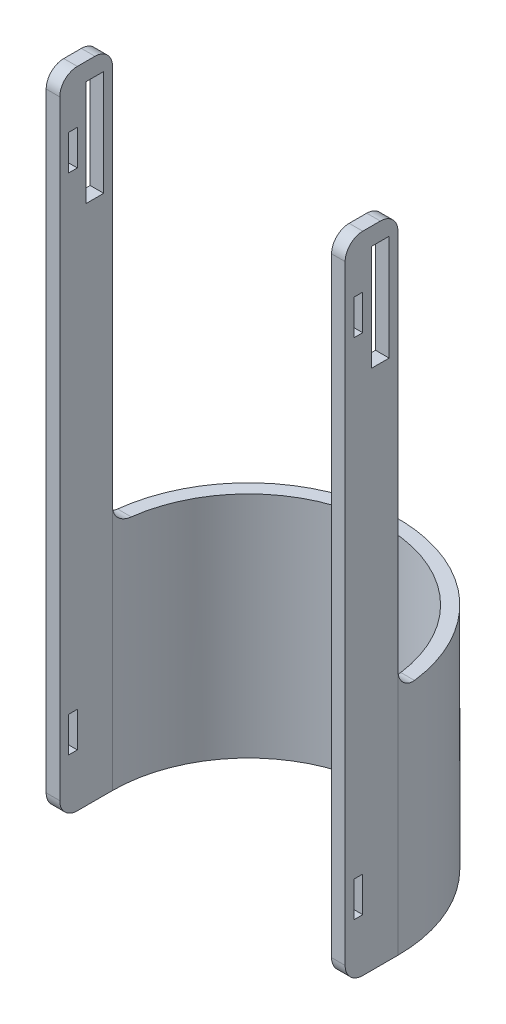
ISO-10303-21;
HEADER;
FILE_DESCRIPTION(('STEP AP214'),'2;1');
FILE_NAME('part.step','',(''),(''),'','','');
FILE_SCHEMA(('AUTOMOTIVE_DESIGN { 1 0 10303 214 1 1 1 1 }'));
ENDSEC;
DATA;
#1=APPLICATION_CONTEXT('core data for automotive mechanical design processes');
#2=APPLICATION_PROTOCOL_DEFINITION('international standard','automotive_design',2000,#1);
#3=PRODUCT_CONTEXT('',#1,'mechanical');
#4=PRODUCT('Part','Part','',(#3));
#5=PRODUCT_RELATED_PRODUCT_CATEGORY('part','',(#4));
#6=PRODUCT_DEFINITION_FORMATION('','',#4);
#7=PRODUCT_DEFINITION_CONTEXT('part definition',#1,'design');
#8=PRODUCT_DEFINITION('design','',#6,#7);
#9=PRODUCT_DEFINITION_SHAPE('','',#8);
#10=(LENGTH_UNIT() NAMED_UNIT(*) SI_UNIT(.MILLI.,.METRE.));
#11=(NAMED_UNIT(*) PLANE_ANGLE_UNIT() SI_UNIT($,.RADIAN.));
#12=(NAMED_UNIT(*) SI_UNIT($,.STERADIAN.) SOLID_ANGLE_UNIT());
#13=UNCERTAINTY_MEASURE_WITH_UNIT(LENGTH_MEASURE(1.E-05),#10,'distance_accuracy_value','');
#14=(GEOMETRIC_REPRESENTATION_CONTEXT(3) GLOBAL_UNCERTAINTY_ASSIGNED_CONTEXT((#13)) GLOBAL_UNIT_ASSIGNED_CONTEXT((#10,
#11,#12)) REPRESENTATION_CONTEXT('',''));
#15=CARTESIAN_POINT('',(0.,0.,0.));
#16=DIRECTION('',(0.,0.,1.));
#17=DIRECTION('',(1.,0.,0.));
#18=AXIS2_PLACEMENT_3D('',#15,#16,#17);
#19=CARTESIAN_POINT('',(0.,130.068859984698,0.));
#20=DIRECTION('',(0.,1.,0.));
#21=DIRECTION('',(0.,0.,1.));
#22=AXIS2_PLACEMENT_3D('',#19,#20,#21);
#23=PLANE('',#22);
#24=CARTESIAN_POINT('',(0.,130.068859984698,0.));
#25=DIRECTION('',(0.,-1.,0.));
#26=DIRECTION('',(0.,0.,1.));
#27=AXIS2_PLACEMENT_3D('',#24,#25,#26);
#28=CIRCLE('',#27,77.2727272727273);
#29=CARTESIAN_POINT('',(-76.6229363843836,130.068859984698,-10.));
#30=VERTEX_POINT('',#29);
#31=CARTESIAN_POINT('',(76.6229363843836,130.068859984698,-9.99999999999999));
#32=VERTEX_POINT('',#31);
#33=EDGE_CURVE('E575',#30,#32,#28,.T.);
#34=ORIENTED_EDGE('',*,*,#33,.T.);
#35=DIRECTION('',(-1.,0.,0.));
#36=VECTOR('',#35,1.);
#37=CARTESIAN_POINT('',(0.,130.068859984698,-9.99999999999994));
#38=LINE('',#37,#36);
#39=CARTESIAN_POINT('',(84.4097150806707,130.068859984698,-10.));
#40=VERTEX_POINT('',#39);
#41=EDGE_CURVE('E680',#32,#40,#38,.F.);
#42=ORIENTED_EDGE('',*,*,#41,.T.);
#43=CARTESIAN_POINT('',(0.,130.068859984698,0.));
#44=DIRECTION('',(0.,1.,0.));
#45=DIRECTION('',(0.,0.,1.));
#46=AXIS2_PLACEMENT_3D('',#43,#44,#45);
#47=CIRCLE('',#46,85.);
#48=CARTESIAN_POINT('',(-84.4097150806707,130.068859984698,-10.));
#49=VERTEX_POINT('',#48);
#50=EDGE_CURVE('E572',#40,#49,#47,.T.);
#51=ORIENTED_EDGE('',*,*,#50,.T.);
#52=DIRECTION('',(-1.,0.,0.));
#53=VECTOR('',#52,1.);
#54=CARTESIAN_POINT('',(0.,130.068859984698,-9.99999999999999));
#55=LINE('',#54,#53);
#56=EDGE_CURVE('E678',#49,#30,#55,.F.);
#57=ORIENTED_EDGE('',*,*,#56,.T.);
#58=EDGE_LOOP('',(#34,#42,#51,#57));
#59=FACE_BOUND('',#58,.T.);
#60=ADVANCED_FACE('F44',(#59),#23,.T.);
#61=CARTESIAN_POINT('',(0.,130.068859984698,0.));
#62=DIRECTION('',(0.,-1.,0.));
#63=DIRECTION('',(0.,0.,-1.));
#64=AXIS2_PLACEMENT_3D('',#61,#62,#63);
#65=CYLINDRICAL_SURFACE('',#64,85.);
#66=DIRECTION('',(0.,-1.,0.));
#67=VECTOR('',#66,1.);
#68=CARTESIAN_POINT('',(26.2664445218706,95.0688599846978,-80.8398038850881));
#69=LINE('',#68,#67);
#70=CARTESIAN_POINT('',(26.2664445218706,95.0688599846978,-80.839803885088));
#71=VERTEX_POINT('',#70);
#72=CARTESIAN_POINT('',(26.2664445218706,35.0688599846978,-80.839803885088));
#73=VERTEX_POINT('',#72);
#74=EDGE_CURVE('E362',#71,#73,#69,.T.);
#75=ORIENTED_EDGE('',*,*,#74,.F.);
#76=CARTESIAN_POINT('',(0.,95.0688599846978,0.));
#77=DIRECTION('',(0.,1.,0.));
#78=DIRECTION('',(0.,0.,1.));
#79=AXIS2_PLACEMENT_3D('',#76,#77,#78);
#80=CIRCLE('',#79,85.);
#81=CARTESIAN_POINT('',(-26.2664445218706,95.0688599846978,-80.839803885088));
#82=VERTEX_POINT('',#81);
#83=EDGE_CURVE('E359',#71,#82,#80,.T.);
#84=ORIENTED_EDGE('',*,*,#83,.T.);
#85=DIRECTION('',(0.,-1.,0.));
#86=VECTOR('',#85,1.);
#87=CARTESIAN_POINT('',(-26.2664445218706,95.0688599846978,-80.8398038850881));
#88=LINE('',#87,#86);
#89=CARTESIAN_POINT('',(-26.2664445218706,35.0688599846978,-80.8398038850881));
#90=VERTEX_POINT('',#89);
#91=EDGE_CURVE('E351',#82,#90,#88,.T.);
#92=ORIENTED_EDGE('',*,*,#91,.T.);
#93=CARTESIAN_POINT('',(0.,35.0688599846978,0.));
#94=DIRECTION('',(0.,1.,0.));
#95=DIRECTION('',(0.,0.,1.));
#96=AXIS2_PLACEMENT_3D('',#93,#94,#95);
#97=CIRCLE('',#96,85.);
#98=EDGE_CURVE('E356',#73,#90,#97,.T.);
#99=ORIENTED_EDGE('',*,*,#98,.F.);
#100=EDGE_LOOP('',(#75,#84,#92,#99));
#101=FACE_BOUND('',#100,.T.);
#102=CARTESIAN_POINT('',(0.,0.,0.));
#103=DIRECTION('',(0.,1.,0.));
#104=DIRECTION('',(0.,0.,1.));
#105=AXIS2_PLACEMENT_3D('',#102,#103,#104);
#106=CIRCLE('',#105,85.);
#107=CARTESIAN_POINT('',(85.,0.,0.));
#108=VERTEX_POINT('',#107);
#109=CARTESIAN_POINT('',(-85.,0.,0.));
#110=VERTEX_POINT('',#109);
#111=EDGE_CURVE('E571',#108,#110,#106,.T.);
#112=ORIENTED_EDGE('',*,*,#111,.T.);
#113=DIRECTION('',(0.,-1.,0.));
#114=VECTOR('',#113,1.);
#115=CARTESIAN_POINT('',(-85.,130.068859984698,0.));
#116=LINE('',#115,#114);
#117=CARTESIAN_POINT('',(-85.,140.068859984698,0.));
#118=VERTEX_POINT('',#117);
#119=EDGE_CURVE('E592',#118,#110,#116,.T.);
#120=ORIENTED_EDGE('',*,*,#119,.F.);
#121=CARTESIAN_POINT('',(-85.,140.068859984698,0.));
#122=CARTESIAN_POINT('',(-84.9999894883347,139.787637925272,3.02271946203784E-05));
#123=CARTESIAN_POINT('',(-84.9999996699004,139.506420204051,-0.0118616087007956));
#124=CARTESIAN_POINT('',(-84.9999854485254,138.945996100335,-0.0592710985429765));
#125=CARTESIAN_POINT('',(-84.9999610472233,138.666789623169,-0.0947876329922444));
#126=CARTESIAN_POINT('',(-84.9998017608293,138.112566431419,-0.189193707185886));
#127=CARTESIAN_POINT('',(-84.9996669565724,137.83754680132,-0.24806612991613));
#128=CARTESIAN_POINT('',(-84.9991402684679,137.2934444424,-0.388755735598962));
#129=CARTESIAN_POINT('',(-84.9987483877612,137.024361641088,-0.470572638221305));
#130=CARTESIAN_POINT('',(-84.9975146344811,136.493912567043,-0.656617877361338));
#131=CARTESIAN_POINT('',(-84.9966725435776,136.232550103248,-0.760857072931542));
#132=CARTESIAN_POINT('',(-84.9943009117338,135.719532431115,-0.990983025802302));
#133=CARTESIAN_POINT('',(-84.9927713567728,135.467877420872,-1.1168702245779));
#134=CARTESIAN_POINT('',(-84.9887534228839,134.976116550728,-1.38936870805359));
#135=CARTESIAN_POINT('',(-84.9862652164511,134.736008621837,-1.53597626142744));
#136=CARTESIAN_POINT('',(-84.98003356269,134.269005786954,-1.84888404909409));
#137=CARTESIAN_POINT('',(-84.976290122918,134.04211080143,-2.01518416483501));
#138=CARTESIAN_POINT('',(-84.9672405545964,133.603278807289,-2.3661833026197));
#139=CARTESIAN_POINT('',(-84.9619353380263,133.391333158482,-2.5508715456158));
#140=CARTESIAN_POINT('',(-84.9494500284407,132.983765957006,-2.93739984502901));
#141=CARTESIAN_POINT('',(-84.942269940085,132.788144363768,-3.13923985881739));
#142=CARTESIAN_POINT('',(-84.9257326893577,132.414590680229,-3.55864657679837));
#143=CARTESIAN_POINT('',(-84.9163752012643,132.236661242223,-3.77621563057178));
#144=CARTESIAN_POINT('',(-84.8952056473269,131.899792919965,-4.22547229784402));
#145=CARTESIAN_POINT('',(-84.8833936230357,131.740853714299,-4.45715967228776));
#146=CARTESIAN_POINT('',(-84.8571007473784,131.443418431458,-4.93243942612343));
#147=CARTESIAN_POINT('',(-84.8426259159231,131.304877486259,-5.17600405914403));
#148=CARTESIAN_POINT('',(-84.8107945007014,131.048781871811,-5.67373976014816));
#149=CARTESIAN_POINT('',(-84.7934379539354,130.931226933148,-5.92791069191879));
#150=CARTESIAN_POINT('',(-84.7557075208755,130.717942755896,-6.44493331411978));
#151=CARTESIAN_POINT('',(-84.7353347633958,130.622205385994,-6.70778172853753));
#152=CARTESIAN_POINT('',(-84.6915016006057,130.453157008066,-7.24023317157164));
#153=CARTESIAN_POINT('',(-84.6680419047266,130.37984086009,-7.50983463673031));
#154=CARTESIAN_POINT('',(-84.6095295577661,130.235097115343,-8.14622446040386));
#155=CARTESIAN_POINT('',(-84.5732408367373,130.172710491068,-8.5150174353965));
#156=CARTESIAN_POINT('',(-84.5148265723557,130.110380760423,-9.07077102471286));
#157=CARTESIAN_POINT('',(-84.4947047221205,130.094812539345,-9.25633884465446));
#158=CARTESIAN_POINT('',(-84.453168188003,130.074052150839,-9.62794666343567));
#159=CARTESIAN_POINT('',(-84.431753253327,130.068862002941,-9.81398674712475));
#160=CARTESIAN_POINT('',(-84.4097150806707,130.068859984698,-10.));
#161=B_SPLINE_CURVE_WITH_KNOTS('',3,(#121,#122,#123,#124,#125,#126,#127,#128,#129,#130,#131,
#132,#133,#134,#135,#136,#137,#138,#139,#140,#141,#142,#143,#144,#145,#146,#147,#148,#149,#150,
#151,#152,#153,#154,#155,#156,#157,#158,#159,#160),.UNSPECIFIED.,.F.,.F.,(4,2,2,2,2,2,2,2,2,2,2,
2,2,2,2,2,2,2,2,4),(0.,0.843408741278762,1.68677751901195,2.52952934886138,3.37227088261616,
4.21542147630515,5.05858926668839,5.90160541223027,6.74461648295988,7.58713626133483,
8.42965394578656,9.27229774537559,10.1149272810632,10.9556747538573,11.796411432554,
12.6368342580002,13.4770642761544,14.601727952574,15.1633944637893,15.7251702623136),.UNSPECIFIED.);
#162=EDGE_CURVE('E721',#118,#49,#161,.T.);
#163=ORIENTED_EDGE('',*,*,#162,.T.);
#164=ORIENTED_EDGE('',*,*,#50,.F.);
#165=CARTESIAN_POINT('',(84.4097150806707,130.068859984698,-10.));
#166=CARTESIAN_POINT('',(84.4427963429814,130.068829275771,-9.72087992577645));
#167=CARTESIAN_POINT('',(84.4744663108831,130.080545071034,-9.4415903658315));
#168=CARTESIAN_POINT('',(84.5348492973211,130.127334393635,-8.88465413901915));
#169=CARTESIAN_POINT('',(84.5635623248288,130.162407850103,-8.6070074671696));
#170=CARTESIAN_POINT('',(84.6178794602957,130.255746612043,-8.0555180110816));
#171=CARTESIAN_POINT('',(84.6434855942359,130.313996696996,-7.78167285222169));
#172=CARTESIAN_POINT('',(84.691572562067,130.453331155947,-7.23958139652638));
#173=CARTESIAN_POINT('',(84.7140534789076,130.534414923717,-6.97133495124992));
#174=CARTESIAN_POINT('',(84.7559359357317,130.71896327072,-6.44219135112));
#175=CARTESIAN_POINT('',(84.7753352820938,130.822443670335,-6.18129953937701));
#176=CARTESIAN_POINT('',(84.8111362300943,131.051055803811,-5.66896121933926));
#177=CARTESIAN_POINT('',(84.8275377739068,131.176187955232,-5.41751489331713));
#178=CARTESIAN_POINT('',(84.8575007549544,131.447202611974,-4.92597095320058));
#179=CARTESIAN_POINT('',(84.8710629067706,131.593079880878,-4.68587049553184));
#180=CARTESIAN_POINT('',(84.8955668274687,131.90458269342,-4.21870297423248));
#181=CARTESIAN_POINT('',(84.9065086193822,132.070208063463,-3.99163579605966));
#182=CARTESIAN_POINT('',(84.9259934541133,132.419399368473,-3.55298082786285));
#183=CARTESIAN_POINT('',(84.9345450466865,132.602898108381,-3.3413399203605));
#184=CARTESIAN_POINT('',(84.9495865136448,132.987039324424,-2.93415559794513));
#185=CARTESIAN_POINT('',(84.9560763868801,133.187681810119,-2.73861219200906));
#186=CARTESIAN_POINT('',(84.9672985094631,133.604736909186,-2.36498104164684));
#187=CARTESIAN_POINT('',(84.9720303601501,133.82115308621,-2.18689726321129));
#188=CARTESIAN_POINT('',(84.9800435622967,134.26817898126,-1.84950824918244));
#189=CARTESIAN_POINT('',(84.9833249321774,134.498788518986,-1.69020277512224));
#190=CARTESIAN_POINT('',(84.9887455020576,134.972989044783,-1.39123721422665));
#191=CARTESIAN_POINT('',(84.9908826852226,135.216602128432,-1.25161213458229));
#192=CARTESIAN_POINT('',(84.9942937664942,135.714702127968,-0.993334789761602));
#193=CARTESIAN_POINT('',(84.9955676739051,135.969188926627,-0.874682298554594));
#194=CARTESIAN_POINT('',(84.9975118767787,136.487136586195,-0.659235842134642));
#195=CARTESIAN_POINT('',(84.9981824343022,136.750593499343,-0.562432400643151));
#196=CARTESIAN_POINT('',(84.9991420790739,137.284606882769,-0.39132769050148));
#197=CARTESIAN_POINT('',(84.9994312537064,137.555161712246,-0.317021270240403));
#198=CARTESIAN_POINT('',(84.9998733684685,138.195688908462,-0.169788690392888));
#199=CARTESIAN_POINT('',(84.9999452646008,138.567854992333,-0.106124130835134));
#200=CARTESIAN_POINT('',(84.9999915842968,139.129213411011,-0.042462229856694));
#201=CARTESIAN_POINT('',(84.9999967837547,139.316749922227,-0.0265474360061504));
#202=CARTESIAN_POINT('',(85.0000002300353,139.692461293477,-0.00531624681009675));
#203=CARTESIAN_POINT('',(84.999998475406,139.880636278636,-2.06539419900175E-06));
#204=CARTESIAN_POINT('',(85.,140.068859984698,0.));
#205=B_SPLINE_CURVE_WITH_KNOTS('',3,(#165,#166,#167,#168,#169,#170,#171,#172,#173,#174,#175,
#176,#177,#178,#179,#180,#181,#182,#183,#184,#185,#186,#187,#188,#189,#190,#191,#192,#193,#194,
#195,#196,#197,#198,#199,#200,#201,#202,#203,#204),.UNSPECIFIED.,.F.,.F.,(4,2,2,2,2,2,2,2,2,2,2,
2,2,2,2,2,2,2,2,4),(0.,0.842976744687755,1.68595093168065,2.52837243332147,3.37077157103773,
4.21376771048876,5.05678010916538,5.89958009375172,6.74237267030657,7.58211082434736,
8.42184944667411,9.26177837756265,10.1016966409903,10.9430905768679,11.7844754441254,
12.6254946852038,13.4663211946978,14.5962905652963,15.1606715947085,15.7251704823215),.UNSPECIFIED.);
#206=CARTESIAN_POINT('',(85.,140.068859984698,0.));
#207=VERTEX_POINT('',#206);
#208=EDGE_CURVE('E693',#40,#207,#205,.T.);
#209=ORIENTED_EDGE('',*,*,#208,.T.);
#210=DIRECTION('',(0.,-1.,0.));
#211=VECTOR('',#210,1.);
#212=CARTESIAN_POINT('',(85.,130.068859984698,0.));
#213=LINE('',#212,#211);
#214=EDGE_CURVE('E579',#207,#108,#213,.T.);
#215=ORIENTED_EDGE('',*,*,#214,.T.);
#216=EDGE_LOOP('',(#112,#120,#163,#164,#209,#215));
#217=FACE_BOUND('',#216,.T.);
#218=ADVANCED_FACE('F354',(#101,#217),#65,.T.);
#219=CARTESIAN_POINT('',(0.,130.068859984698,0.));
#220=DIRECTION('',(0.,-1.,0.));
#221=DIRECTION('',(0.,0.,-1.));
#222=AXIS2_PLACEMENT_3D('',#219,#220,#221);
#223=CYLINDRICAL_SURFACE('',#222,77.2727272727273);
#224=CARTESIAN_POINT('',(0.,0.,0.));
#225=DIRECTION('',(0.,-1.,0.));
#226=DIRECTION('',(0.,0.,1.));
#227=AXIS2_PLACEMENT_3D('',#224,#225,#226);
#228=CIRCLE('',#227,77.2727272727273);
#229=CARTESIAN_POINT('',(-77.2727272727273,0.,0.));
#230=VERTEX_POINT('',#229);
#231=CARTESIAN_POINT('',(77.2727272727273,0.,0.));
#232=VERTEX_POINT('',#231);
#233=EDGE_CURVE('E576',#230,#232,#228,.T.);
#234=ORIENTED_EDGE('',*,*,#233,.T.);
#235=DIRECTION('',(0.,-1.,0.));
#236=VECTOR('',#235,1.);
#237=CARTESIAN_POINT('',(77.2727272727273,130.068859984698,0.));
#238=LINE('',#237,#236);
#239=CARTESIAN_POINT('',(77.2727272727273,140.068859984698,0.));
#240=VERTEX_POINT('',#239);
#241=EDGE_CURVE('E586',#240,#232,#238,.T.);
#242=ORIENTED_EDGE('',*,*,#241,.F.);
#243=CARTESIAN_POINT('',(77.2727272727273,140.068859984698,0.));
#244=CARTESIAN_POINT('',(77.27271571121,139.787646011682,3.02237150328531E-05));
#245=CARTESIAN_POINT('',(77.2727269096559,139.506436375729,-0.0118609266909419));
#246=CARTESIAN_POINT('',(77.2727112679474,138.946028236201,-0.0592676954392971));
#247=CARTESIAN_POINT('',(77.2726844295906,138.666829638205,-0.0947821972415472));
#248=CARTESIAN_POINT('',(77.2725092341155,138.112620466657,-0.189183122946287));
#249=CARTESIAN_POINT('',(77.2723609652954,137.837606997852,-0.248052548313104));
#250=CARTESIAN_POINT('',(77.2717816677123,137.293516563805,-0.388735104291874));
#251=CARTESIAN_POINT('',(77.2713506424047,137.024439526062,-0.470547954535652));
#252=CARTESIAN_POINT('',(77.2699936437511,136.494001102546,-0.65658419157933));
#253=CARTESIAN_POINT('',(77.2690674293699,136.232643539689,-0.760818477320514));
#254=CARTESIAN_POINT('',(77.2664588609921,135.719635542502,-0.990933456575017));
#255=CARTESIAN_POINT('',(77.2647764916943,135.467985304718,-1.11681458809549));
#256=CARTESIAN_POINT('',(77.2603571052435,134.97623408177,-1.38929943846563));
#257=CARTESIAN_POINT('',(77.2576202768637,134.736131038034,-1.53589944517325));
#258=CARTESIAN_POINT('',(77.2507659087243,134.269139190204,-1.84878946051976));
#259=CARTESIAN_POINT('',(77.2466483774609,134.042250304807,-2.01507934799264));
#260=CARTESIAN_POINT('',(77.2366950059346,133.603459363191,-2.36603212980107));
#261=CARTESIAN_POINT('',(77.2308603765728,133.391546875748,-2.5506820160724));
#262=CARTESIAN_POINT('',(77.2171293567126,132.984045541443,-2.93712155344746));
#263=CARTESIAN_POINT('',(77.2092329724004,132.788456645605,-3.13891115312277));
#264=CARTESIAN_POINT('',(77.1910463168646,132.414970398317,-3.55819837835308));
#265=CARTESIAN_POINT('',(77.1807557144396,132.23707549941,-3.77569817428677));
#266=CARTESIAN_POINT('',(77.1574756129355,131.90027552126,-4.2247937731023));
#267=CARTESIAN_POINT('',(77.1444861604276,131.741370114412,-4.45638933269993));
#268=CARTESIAN_POINT('',(77.1155805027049,131.44407596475,-4.93133425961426));
#269=CARTESIAN_POINT('',(77.0996724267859,131.305632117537,-5.17464962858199));
#270=CARTESIAN_POINT('',(77.0646918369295,131.049702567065,-5.6718388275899));
#271=CARTESIAN_POINT('',(77.0456193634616,130.932216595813,-5.92571252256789));
#272=CARTESIAN_POINT('',(77.0041613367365,130.719032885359,-6.44209192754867));
#273=CARTESIAN_POINT('',(76.9817769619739,130.623327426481,-6.70459454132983));
#274=CARTESIAN_POINT('',(76.9336188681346,130.454298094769,-7.23629664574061));
#275=CARTESIAN_POINT('',(76.9078459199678,130.380969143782,-7.50549460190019));
#276=CARTESIAN_POINT('',(76.8434207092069,130.235798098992,-8.14232224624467));
#277=CARTESIAN_POINT('',(76.8033871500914,130.173137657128,-8.51196880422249));
#278=CARTESIAN_POINT('',(76.7389337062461,130.110545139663,-9.06892852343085));
#279=CARTESIAN_POINT('',(76.7167299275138,130.094913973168,-9.25488508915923));
#280=CARTESIAN_POINT('',(76.6708927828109,130.074071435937,-9.62724190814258));
#281=CARTESIAN_POINT('',(76.6472591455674,130.068862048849,-9.81364223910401));
#282=CARTESIAN_POINT('',(76.6229363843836,130.068859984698,-10.));
#283=B_SPLINE_CURVE_WITH_KNOTS('',3,(#243,#244,#245,#246,#247,#248,#249,#250,#251,#252,#253,
#254,#255,#256,#257,#258,#259,#260,#261,#262,#263,#264,#265,#266,#267,#268,#269,#270,#271,#272,
#273,#274,#275,#276,#277,#278,#279,#280,#281,#282),.UNSPECIFIED.,.F.,.F.,(4,2,2,2,2,2,2,2,2,2,2,
2,2,2,2,2,2,2,2,4),(0.,0.843384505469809,1.6867291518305,2.52946110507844,3.37218276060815,
4.2153149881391,5.05846427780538,5.90146269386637,6.74445592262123,7.58685608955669,
8.42925372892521,9.2717679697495,10.1142676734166,10.9544554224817,11.7946324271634,
12.634511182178,13.4741991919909,14.6026221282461,15.166161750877,15.7298086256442),.UNSPECIFIED.);
#284=EDGE_CURVE('E685',#240,#32,#283,.T.);
#285=ORIENTED_EDGE('',*,*,#284,.T.);
#286=ORIENTED_EDGE('',*,*,#33,.F.);
#287=CARTESIAN_POINT('',(-76.6229363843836,130.068859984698,-10.));
#288=CARTESIAN_POINT('',(-76.6593206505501,130.068829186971,-9.7213306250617));
#289=CARTESIAN_POINT('',(-76.6941554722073,130.080507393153,-9.4424553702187));
#290=CARTESIAN_POINT('',(-76.7605783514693,130.12716384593,-8.88627038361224));
#291=CARTESIAN_POINT('',(-76.7921663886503,130.162142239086,-8.60896066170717));
#292=CARTESIAN_POINT('',(-76.8519283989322,130.255251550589,-8.0580623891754));
#293=CARTESIAN_POINT('',(-76.8801045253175,130.313367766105,-7.78447158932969));
#294=CARTESIAN_POINT('',(-76.933022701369,130.452409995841,-7.2428173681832));
#295=CARTESIAN_POINT('',(-76.9577648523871,130.533335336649,-6.97475378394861));
#296=CARTESIAN_POINT('',(-77.0038655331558,130.717559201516,-6.44589783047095));
#297=CARTESIAN_POINT('',(-77.0252214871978,130.820874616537,-6.18511111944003));
#298=CARTESIAN_POINT('',(-77.0646368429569,131.049156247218,-5.67292752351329));
#299=CARTESIAN_POINT('',(-77.0826961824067,131.174122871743,-5.42153081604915));
#300=CARTESIAN_POINT('',(-77.1156903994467,131.444810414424,-4.93004376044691));
#301=CARTESIAN_POINT('',(-77.1306261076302,131.590525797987,-4.68995041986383));
#302=CARTESIAN_POINT('',(-77.1576142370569,131.901713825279,-4.2227602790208));
#303=CARTESIAN_POINT('',(-77.1696666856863,132.067186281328,-3.99566335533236));
#304=CARTESIAN_POINT('',(-77.1911233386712,132.415951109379,-3.55708611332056));
#305=CARTESIAN_POINT('',(-77.2005389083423,132.599162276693,-3.34554176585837));
#306=CARTESIAN_POINT('',(-77.2171035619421,132.982714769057,-2.93850267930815));
#307=CARTESIAN_POINT('',(-77.2242526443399,133.183056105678,-2.74300795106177));
#308=CARTESIAN_POINT('',(-77.2366178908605,133.599499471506,-2.36942730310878));
#309=CARTESIAN_POINT('',(-77.2418336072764,133.81560513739,-2.19134542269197));
#310=CARTESIAN_POINT('',(-77.2506690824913,134.262003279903,-1.8539151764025));
#311=CARTESIAN_POINT('',(-77.2542888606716,134.492295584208,-1.69456658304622));
#312=CARTESIAN_POINT('',(-77.2602718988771,134.965932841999,-1.39542275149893));
#313=CARTESIAN_POINT('',(-77.2626325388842,135.209303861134,-1.2556687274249));
#314=CARTESIAN_POINT('',(-77.2664020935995,135.706927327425,-0.997102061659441));
#315=CARTESIAN_POINT('',(-77.2678110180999,135.961179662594,-0.878289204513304));
#316=CARTESIAN_POINT('',(-77.2699627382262,136.478670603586,-0.662490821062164));
#317=CARTESIAN_POINT('',(-77.270705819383,136.741905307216,-0.565495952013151));
#318=CARTESIAN_POINT('',(-77.2717703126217,137.275488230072,-0.393978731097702));
#319=CARTESIAN_POINT('',(-77.2720918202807,137.54583482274,-0.319451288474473));
#320=CARTESIAN_POINT('',(-77.272585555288,138.18766573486,-0.171258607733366));
#321=CARTESIAN_POINT('',(-77.2726660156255,138.56139918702,-0.107043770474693));
#322=CARTESIAN_POINT('',(-77.2727178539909,139.125153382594,-0.0428306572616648));
#323=CARTESIAN_POINT('',(-77.2727236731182,139.313497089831,-0.0267778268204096));
#324=CARTESIAN_POINT('',(-77.2727275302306,139.690830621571,-0.00536244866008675));
#325=CARTESIAN_POINT('',(-77.2727255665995,139.879820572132,-2.1217133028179E-06));
#326=CARTESIAN_POINT('',(-77.2727272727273,140.068859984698,0.));
#327=B_SPLINE_CURVE_WITH_KNOTS('',3,(#287,#288,#289,#290,#291,#292,#293,#294,#295,#296,#297,
#298,#299,#300,#301,#302,#303,#304,#305,#306,#307,#308,#309,#310,#311,#312,#313,#314,#315,#316,
#317,#318,#319,#320,#321,#322,#323,#324,#325,#326),.UNSPECIFIED.,.F.,.F.,(4,2,2,2,2,2,2,2,2,2,2,
2,2,2,2,2,2,2,2,4),(0.,0.842862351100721,1.68573000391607,2.52806291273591,3.37037095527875,
4.21331665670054,5.05627827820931,5.89901546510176,6.7417446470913,7.58078359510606,
8.41982310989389,9.25905679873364,10.0982802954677,10.9392433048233,11.7801976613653,
12.6207912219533,13.4611941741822,14.5960393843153,15.1628652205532,15.7298087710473),.UNSPECIFIED.);
#328=CARTESIAN_POINT('',(-77.2727272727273,140.068859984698,0.));
#329=VERTEX_POINT('',#328);
#330=EDGE_CURVE('E727',#30,#329,#327,.T.);
#331=ORIENTED_EDGE('',*,*,#330,.T.);
#332=DIRECTION('',(0.,-1.,0.));
#333=VECTOR('',#332,1.);
#334=CARTESIAN_POINT('',(-77.2727272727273,130.068859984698,0.));
#335=LINE('',#334,#333);
#336=EDGE_CURVE('E589',#329,#230,#335,.T.);
#337=ORIENTED_EDGE('',*,*,#336,.T.);
#338=EDGE_LOOP('',(#234,#242,#285,#286,#331,#337));
#339=FACE_BOUND('',#338,.T.);
#340=ADVANCED_FACE('F700',(#339),#223,.F.);
#341=CARTESIAN_POINT('',(0.,0.,0.));
#342=DIRECTION('',(0.,1.,0.));
#343=DIRECTION('',(0.,0.,1.));
#344=AXIS2_PLACEMENT_3D('',#341,#342,#343);
#345=PLANE('',#344);
#346=DIRECTION('',(0.,0.,-1.));
#347=VECTOR('',#346,1.);
#348=CARTESIAN_POINT('',(85.,0.,30.));
#349=LINE('',#348,#347);
#350=CARTESIAN_POINT('',(85.,0.,20.));
#351=VERTEX_POINT('',#350);
#352=EDGE_CURVE('E567',#351,#108,#349,.T.);
#353=ORIENTED_EDGE('',*,*,#352,.F.);
#354=DIRECTION('',(1.,0.,0.));
#355=VECTOR('',#354,1.);
#356=CARTESIAN_POINT('',(77.2727272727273,0.,20.));
#357=LINE('',#356,#355);
#358=CARTESIAN_POINT('',(77.2727272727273,0.,20.));
#359=VERTEX_POINT('',#358);
#360=EDGE_CURVE('E664',#351,#359,#357,.F.);
#361=ORIENTED_EDGE('',*,*,#360,.T.);
#362=DIRECTION('',(0.,0.,-1.));
#363=VECTOR('',#362,1.);
#364=CARTESIAN_POINT('',(77.2727272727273,0.,30.));
#365=LINE('',#364,#363);
#366=EDGE_CURVE('E569',#359,#232,#365,.T.);
#367=ORIENTED_EDGE('',*,*,#366,.T.);
#368=ORIENTED_EDGE('',*,*,#233,.F.);
#369=DIRECTION('',(0.,0.,-1.));
#370=VECTOR('',#369,1.);
#371=CARTESIAN_POINT('',(-77.2727272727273,0.,30.));
#372=LINE('',#371,#370);
#373=CARTESIAN_POINT('',(-77.2727272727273,0.,20.));
#374=VERTEX_POINT('',#373);
#375=EDGE_CURVE('E555',#374,#230,#372,.T.);
#376=ORIENTED_EDGE('',*,*,#375,.F.);
#377=DIRECTION('',(1.,0.,0.));
#378=VECTOR('',#377,1.);
#379=CARTESIAN_POINT('',(-85.,0.,20.));
#380=LINE('',#379,#378);
#381=CARTESIAN_POINT('',(-85.,0.,20.));
#382=VERTEX_POINT('',#381);
#383=EDGE_CURVE('E662',#374,#382,#380,.F.);
#384=ORIENTED_EDGE('',*,*,#383,.T.);
#385=DIRECTION('',(0.,0.,-1.));
#386=VECTOR('',#385,1.);
#387=CARTESIAN_POINT('',(-85.,0.,30.));
#388=LINE('',#387,#386);
#389=EDGE_CURVE('E553',#382,#110,#388,.T.);
#390=ORIENTED_EDGE('',*,*,#389,.T.);
#391=ORIENTED_EDGE('',*,*,#111,.F.);
#392=EDGE_LOOP('',(#353,#361,#367,#368,#376,#384,#390,#391));
#393=FACE_BOUND('',#392,.T.);
#394=ADVANCED_FACE('F841',(#393),#345,.F.);
#395=CARTESIAN_POINT('',(77.2727272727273,130.068859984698,30.));
#396=DIRECTION('',(1.,0.,0.));
#397=DIRECTION('',(0.,1.,0.));
#398=AXIS2_PLACEMENT_3D('',#395,#396,#397);
#399=PLANE('',#398);
#400=DIRECTION('',(0.,0.,-1.));
#401=VECTOR('',#400,1.);
#402=CARTESIAN_POINT('',(77.2727272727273,30.,30.));
#403=LINE('',#402,#401);
#404=CARTESIAN_POINT('',(77.2727272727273,30.,25.));
#405=VERTEX_POINT('',#404);
#406=CARTESIAN_POINT('',(77.2727272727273,30.,20.));
#407=VERTEX_POINT('',#406);
#408=EDGE_CURVE('E408',#405,#407,#403,.T.);
#409=ORIENTED_EDGE('',*,*,#408,.T.);
#410=DIRECTION('',(0.,1.,0.));
#411=VECTOR('',#410,1.);
#412=CARTESIAN_POINT('',(77.2727272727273,130.068859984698,20.));
#413=LINE('',#412,#411);
#414=CARTESIAN_POINT('',(77.2727272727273,50.,20.));
#415=VERTEX_POINT('',#414);
#416=EDGE_CURVE('E428',#407,#415,#413,.T.);
#417=ORIENTED_EDGE('',*,*,#416,.T.);
#418=DIRECTION('',(0.,0.,1.));
#419=VECTOR('',#418,1.);
#420=CARTESIAN_POINT('',(77.2727272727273,50.,30.));
#421=LINE('',#420,#419);
#422=CARTESIAN_POINT('',(77.2727272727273,50.,25.));
#423=VERTEX_POINT('',#422);
#424=EDGE_CURVE('E425',#415,#423,#421,.T.);
#425=ORIENTED_EDGE('',*,*,#424,.T.);
#426=DIRECTION('',(0.,-1.,0.));
#427=VECTOR('',#426,1.);
#428=CARTESIAN_POINT('',(77.2727272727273,130.068859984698,25.));
#429=LINE('',#428,#427);
#430=EDGE_CURVE('E422',#423,#405,#429,.T.);
#431=ORIENTED_EDGE('',*,*,#430,.T.);
#432=EDGE_LOOP('',(#409,#417,#425,#431));
#433=FACE_BOUND('',#432,.T.);
#434=DIRECTION('',(0.,0.,-1.));
#435=VECTOR('',#434,1.);
#436=CARTESIAN_POINT('',(77.2727272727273,316.568859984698,30.));
#437=LINE('',#436,#435);
#438=CARTESIAN_POINT('',(77.2727272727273,316.568859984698,25.));
#439=VERTEX_POINT('',#438);
#440=CARTESIAN_POINT('',(77.2727272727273,316.568859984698,20.));
#441=VERTEX_POINT('',#440);
#442=EDGE_CURVE('E458',#439,#441,#437,.T.);
#443=ORIENTED_EDGE('',*,*,#442,.T.);
#444=DIRECTION('',(0.,1.,0.));
#445=VECTOR('',#444,1.);
#446=CARTESIAN_POINT('',(77.2727272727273,130.068859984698,20.));
#447=LINE('',#446,#445);
#448=CARTESIAN_POINT('',(77.2727272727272,336.568859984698,20.));
#449=VERTEX_POINT('',#448);
#450=EDGE_CURVE('E478',#441,#449,#447,.T.);
#451=ORIENTED_EDGE('',*,*,#450,.T.);
#452=DIRECTION('',(0.,0.,1.));
#453=VECTOR('',#452,1.);
#454=CARTESIAN_POINT('',(77.2727272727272,336.568859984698,30.));
#455=LINE('',#454,#453);
#456=CARTESIAN_POINT('',(77.2727272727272,336.568859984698,25.));
#457=VERTEX_POINT('',#456);
#458=EDGE_CURVE('E475',#449,#457,#455,.T.);
#459=ORIENTED_EDGE('',*,*,#458,.T.);
#460=DIRECTION('',(0.,-1.,0.));
#461=VECTOR('',#460,1.);
#462=CARTESIAN_POINT('',(77.2727272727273,130.068859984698,25.));
#463=LINE('',#462,#461);
#464=EDGE_CURVE('E472',#457,#439,#463,.T.);
#465=ORIENTED_EDGE('',*,*,#464,.T.);
#466=EDGE_LOOP('',(#443,#451,#459,#465));
#467=FACE_BOUND('',#466,.T.);
#468=DIRECTION('',(0.,0.,-1.));
#469=VECTOR('',#468,1.);
#470=CARTESIAN_POINT('',(77.2727272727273,296.568859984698,30.));
#471=LINE('',#470,#469);
#472=CARTESIAN_POINT('',(77.2727272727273,296.568859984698,15.));
#473=VERTEX_POINT('',#472);
#474=CARTESIAN_POINT('',(77.2727272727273,296.568859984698,5.00000000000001));
#475=VERTEX_POINT('',#474);
#476=EDGE_CURVE('E508',#473,#475,#471,.T.);
#477=ORIENTED_EDGE('',*,*,#476,.T.);
#478=DIRECTION('',(0.,1.,0.));
#479=VECTOR('',#478,1.);
#480=CARTESIAN_POINT('',(77.2727272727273,130.068859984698,5.00000000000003));
#481=LINE('',#480,#479);
#482=CARTESIAN_POINT('',(77.2727272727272,356.568859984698,5.));
#483=VERTEX_POINT('',#482);
#484=EDGE_CURVE('E526',#475,#483,#481,.T.);
#485=ORIENTED_EDGE('',*,*,#484,.T.);
#486=DIRECTION('',(0.,0.,1.));
#487=VECTOR('',#486,1.);
#488=CARTESIAN_POINT('',(77.2727272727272,356.568859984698,30.));
#489=LINE('',#488,#487);
#490=CARTESIAN_POINT('',(77.2727272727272,356.568859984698,15.));
#491=VERTEX_POINT('',#490);
#492=EDGE_CURVE('E520',#483,#491,#489,.T.);
#493=ORIENTED_EDGE('',*,*,#492,.T.);
#494=DIRECTION('',(0.,-1.,0.));
#495=VECTOR('',#494,1.);
#496=CARTESIAN_POINT('',(77.2727272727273,130.068859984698,15.));
#497=LINE('',#496,#495);
#498=EDGE_CURVE('E514',#491,#473,#497,.T.);
#499=ORIENTED_EDGE('',*,*,#498,.T.);
#500=EDGE_LOOP('',(#477,#485,#493,#499));
#501=FACE_BOUND('',#500,.T.);
#502=ORIENTED_EDGE('',*,*,#366,.F.);
#503=CARTESIAN_POINT('',(77.2727272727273,10.,20.));
#504=DIRECTION('',(1.,0.,0.));
#505=DIRECTION('',(0.,1.,0.));
#506=AXIS2_PLACEMENT_3D('',#503,#504,#505);
#507=CIRCLE('',#506,10.);
#508=CARTESIAN_POINT('',(77.2727272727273,9.99999999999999,30.));
#509=VERTEX_POINT('',#508);
#510=EDGE_CURVE('E666',#359,#509,#507,.F.);
#511=ORIENTED_EDGE('',*,*,#510,.T.);
#512=DIRECTION('',(0.,-1.,0.));
#513=VECTOR('',#512,1.);
#514=CARTESIAN_POINT('',(77.2727272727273,130.068859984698,30.));
#515=LINE('',#514,#513);
#516=CARTESIAN_POINT('',(77.2727272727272,356.568859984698,30.));
#517=VERTEX_POINT('',#516);
#518=EDGE_CURVE('E562',#517,#509,#515,.T.);
#519=ORIENTED_EDGE('',*,*,#518,.F.);
#520=CARTESIAN_POINT('',(77.2727272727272,356.568859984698,20.));
#521=DIRECTION('',(1.,0.,0.));
#522=DIRECTION('',(0.,1.,0.));
#523=AXIS2_PLACEMENT_3D('',#520,#521,#522);
#524=CIRCLE('',#523,10.);
#525=CARTESIAN_POINT('',(77.2727272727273,366.568859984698,20.));
#526=VERTEX_POINT('',#525);
#527=EDGE_CURVE('E634',#517,#526,#524,.F.);
#528=ORIENTED_EDGE('',*,*,#527,.T.);
#529=DIRECTION('',(0.,0.,1.));
#530=VECTOR('',#529,1.);
#531=CARTESIAN_POINT('',(77.2727272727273,366.568859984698,30.));
#532=LINE('',#531,#530);
#533=CARTESIAN_POINT('',(77.2727272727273,366.568859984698,10.));
#534=VERTEX_POINT('',#533);
#535=EDGE_CURVE('E535',#534,#526,#532,.T.);
#536=ORIENTED_EDGE('',*,*,#535,.F.);
#537=CARTESIAN_POINT('',(77.2727272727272,356.568859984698,10.));
#538=DIRECTION('',(1.,0.,0.));
#539=DIRECTION('',(0.,1.,0.));
#540=AXIS2_PLACEMENT_3D('',#537,#538,#539);
#541=CIRCLE('',#540,10.);
#542=CARTESIAN_POINT('',(77.2727272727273,356.568859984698,0.));
#543=VERTEX_POINT('',#542);
#544=EDGE_CURVE('E632',#534,#543,#541,.F.);
#545=ORIENTED_EDGE('',*,*,#544,.T.);
#546=DIRECTION('',(0.,-1.,0.));
#547=VECTOR('',#546,1.);
#548=CARTESIAN_POINT('',(77.2727272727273,366.568859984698,0.));
#549=LINE('',#548,#547);
#550=EDGE_CURVE('E532',#543,#240,#549,.T.);
#551=ORIENTED_EDGE('',*,*,#550,.T.);
#552=ORIENTED_EDGE('',*,*,#241,.T.);
#553=EDGE_LOOP('',(#502,#511,#519,#528,#536,#545,#551,#552));
#554=FACE_BOUND('',#553,.T.);
#555=ADVANCED_FACE('F839',(#433,#467,#501,#554),#399,.F.);
#556=CARTESIAN_POINT('',(85.,130.068859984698,30.));
#557=DIRECTION('',(-1.,0.,0.));
#558=DIRECTION('',(0.,-1.,0.));
#559=AXIS2_PLACEMENT_3D('',#556,#557,#558);
#560=PLANE('',#559);
#561=DIRECTION('',(0.,0.,-1.));
#562=VECTOR('',#561,1.);
#563=CARTESIAN_POINT('',(85.,50.,20.));
#564=LINE('',#563,#562);
#565=CARTESIAN_POINT('',(85.,50.,25.));
#566=VERTEX_POINT('',#565);
#567=CARTESIAN_POINT('',(85.,50.,20.));
#568=VERTEX_POINT('',#567);
#569=EDGE_CURVE('E392',#566,#568,#564,.T.);
#570=ORIENTED_EDGE('',*,*,#569,.T.);
#571=DIRECTION('',(0.,-1.,0.));
#572=VECTOR('',#571,1.);
#573=CARTESIAN_POINT('',(85.,50.,20.));
#574=LINE('',#573,#572);
#575=CARTESIAN_POINT('',(85.,30.,20.));
#576=VERTEX_POINT('',#575);
#577=EDGE_CURVE('E382',#568,#576,#574,.T.);
#578=ORIENTED_EDGE('',*,*,#577,.T.);
#579=DIRECTION('',(0.,0.,1.));
#580=VECTOR('',#579,1.);
#581=CARTESIAN_POINT('',(85.,30.,20.));
#582=LINE('',#581,#580);
#583=CARTESIAN_POINT('',(85.,30.,25.));
#584=VERTEX_POINT('',#583);
#585=EDGE_CURVE('E385',#576,#584,#582,.T.);
#586=ORIENTED_EDGE('',*,*,#585,.T.);
#587=DIRECTION('',(0.,1.,0.));
#588=VECTOR('',#587,1.);
#589=CARTESIAN_POINT('',(85.,50.,25.));
#590=LINE('',#589,#588);
#591=EDGE_CURVE('E389',#584,#566,#590,.T.);
#592=ORIENTED_EDGE('',*,*,#591,.T.);
#593=EDGE_LOOP('',(#570,#578,#586,#592));
#594=FACE_BOUND('',#593,.T.);
#595=DIRECTION('',(0.,0.,-1.));
#596=VECTOR('',#595,1.);
#597=CARTESIAN_POINT('',(85.,336.568859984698,20.));
#598=LINE('',#597,#596);
#599=CARTESIAN_POINT('',(85.,336.568859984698,25.));
#600=VERTEX_POINT('',#599);
#601=CARTESIAN_POINT('',(85.,336.568859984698,20.));
#602=VERTEX_POINT('',#601);
#603=EDGE_CURVE('E442',#600,#602,#598,.T.);
#604=ORIENTED_EDGE('',*,*,#603,.T.);
#605=DIRECTION('',(0.,-1.,0.));
#606=VECTOR('',#605,1.);
#607=CARTESIAN_POINT('',(85.,336.568859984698,20.));
#608=LINE('',#607,#606);
#609=CARTESIAN_POINT('',(85.,316.568859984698,20.));
#610=VERTEX_POINT('',#609);
#611=EDGE_CURVE('E432',#602,#610,#608,.T.);
#612=ORIENTED_EDGE('',*,*,#611,.T.);
#613=DIRECTION('',(0.,0.,1.));
#614=VECTOR('',#613,1.);
#615=CARTESIAN_POINT('',(85.,316.568859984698,20.));
#616=LINE('',#615,#614);
#617=CARTESIAN_POINT('',(85.,316.568859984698,25.));
#618=VERTEX_POINT('',#617);
#619=EDGE_CURVE('E435',#610,#618,#616,.T.);
#620=ORIENTED_EDGE('',*,*,#619,.T.);
#621=DIRECTION('',(0.,1.,0.));
#622=VECTOR('',#621,1.);
#623=CARTESIAN_POINT('',(85.,336.568859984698,25.));
#624=LINE('',#623,#622);
#625=EDGE_CURVE('E439',#618,#600,#624,.T.);
#626=ORIENTED_EDGE('',*,*,#625,.T.);
#627=EDGE_LOOP('',(#604,#612,#620,#626));
#628=FACE_BOUND('',#627,.T.);
#629=DIRECTION('',(0.,0.,-1.));
#630=VECTOR('',#629,1.);
#631=CARTESIAN_POINT('',(85.,356.568859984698,30.));
#632=LINE('',#631,#630);
#633=CARTESIAN_POINT('',(85.,356.568859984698,15.));
#634=VERTEX_POINT('',#633);
#635=CARTESIAN_POINT('',(85.,356.568859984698,5.));
#636=VERTEX_POINT('',#635);
#637=EDGE_CURVE('E517',#634,#636,#632,.T.);
#638=ORIENTED_EDGE('',*,*,#637,.T.);
#639=DIRECTION('',(0.,-1.,0.));
#640=VECTOR('',#639,1.);
#641=CARTESIAN_POINT('',(85.,130.068859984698,5.00000000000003));
#642=LINE('',#641,#640);
#643=CARTESIAN_POINT('',(85.,296.568859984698,5.00000000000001));
#644=VERTEX_POINT('',#643);
#645=EDGE_CURVE('E523',#636,#644,#642,.T.);
#646=ORIENTED_EDGE('',*,*,#645,.T.);
#647=DIRECTION('',(0.,0.,1.));
#648=VECTOR('',#647,1.);
#649=CARTESIAN_POINT('',(85.,296.568859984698,30.));
#650=LINE('',#649,#648);
#651=CARTESIAN_POINT('',(85.,296.568859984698,15.));
#652=VERTEX_POINT('',#651);
#653=EDGE_CURVE('E505',#644,#652,#650,.T.);
#654=ORIENTED_EDGE('',*,*,#653,.T.);
#655=DIRECTION('',(0.,1.,0.));
#656=VECTOR('',#655,1.);
#657=CARTESIAN_POINT('',(85.,130.068859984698,15.));
#658=LINE('',#657,#656);
#659=EDGE_CURVE('E511',#652,#634,#658,.T.);
#660=ORIENTED_EDGE('',*,*,#659,.T.);
#661=EDGE_LOOP('',(#638,#646,#654,#660));
#662=FACE_BOUND('',#661,.T.);
#663=DIRECTION('',(0.,1.,0.));
#664=VECTOR('',#663,1.);
#665=CARTESIAN_POINT('',(85.,130.068859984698,30.));
#666=LINE('',#665,#664);
#667=CARTESIAN_POINT('',(85.,9.99999999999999,30.));
#668=VERTEX_POINT('',#667);
#669=CARTESIAN_POINT('',(85.,356.568859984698,30.));
#670=VERTEX_POINT('',#669);
#671=EDGE_CURVE('E565',#668,#670,#666,.T.);
#672=ORIENTED_EDGE('',*,*,#671,.F.);
#673=CARTESIAN_POINT('',(85.,10.,20.));
#674=DIRECTION('',(-1.,0.,0.));
#675=DIRECTION('',(0.,-1.,0.));
#676=AXIS2_PLACEMENT_3D('',#673,#674,#675);
#677=CIRCLE('',#676,10.);
#678=EDGE_CURVE('E660',#668,#351,#677,.F.);
#679=ORIENTED_EDGE('',*,*,#678,.T.);
#680=ORIENTED_EDGE('',*,*,#352,.T.);
#681=ORIENTED_EDGE('',*,*,#214,.F.);
#682=DIRECTION('',(0.,-1.,0.));
#683=VECTOR('',#682,1.);
#684=CARTESIAN_POINT('',(85.,366.568859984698,0.));
#685=LINE('',#684,#683);
#686=CARTESIAN_POINT('',(85.,356.568859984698,0.));
#687=VERTEX_POINT('',#686);
#688=EDGE_CURVE('E529',#687,#207,#685,.T.);
#689=ORIENTED_EDGE('',*,*,#688,.F.);
#690=CARTESIAN_POINT('',(85.,356.568859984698,10.));
#691=DIRECTION('',(-1.,0.,0.));
#692=DIRECTION('',(0.,-1.,0.));
#693=AXIS2_PLACEMENT_3D('',#690,#691,#692);
#694=CIRCLE('',#693,10.);
#695=CARTESIAN_POINT('',(85.,366.568859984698,10.));
#696=VERTEX_POINT('',#695);
#697=EDGE_CURVE('E625',#687,#696,#694,.F.);
#698=ORIENTED_EDGE('',*,*,#697,.T.);
#699=DIRECTION('',(0.,0.,-1.));
#700=VECTOR('',#699,1.);
#701=CARTESIAN_POINT('',(85.,366.568859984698,30.));
#702=LINE('',#701,#700);
#703=CARTESIAN_POINT('',(85.,366.568859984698,20.));
#704=VERTEX_POINT('',#703);
#705=EDGE_CURVE('E538',#704,#696,#702,.T.);
#706=ORIENTED_EDGE('',*,*,#705,.F.);
#707=CARTESIAN_POINT('',(85.,356.568859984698,20.));
#708=DIRECTION('',(-1.,0.,0.));
#709=DIRECTION('',(0.,-1.,0.));
#710=AXIS2_PLACEMENT_3D('',#707,#708,#709);
#711=CIRCLE('',#710,10.);
#712=EDGE_CURVE('E627',#704,#670,#711,.F.);
#713=ORIENTED_EDGE('',*,*,#712,.T.);
#714=EDGE_LOOP('',(#672,#679,#680,#681,#689,#698,#706,#713));
#715=FACE_BOUND('',#714,.T.);
#716=ADVANCED_FACE('F848',(#594,#628,#662,#715),#560,.F.);
#717=CARTESIAN_POINT('',(0.,0.,30.));
#718=DIRECTION('',(0.,0.,1.));
#719=DIRECTION('',(1.,0.,0.));
#720=AXIS2_PLACEMENT_3D('',#717,#718,#719);
#721=PLANE('',#720);
#722=ORIENTED_EDGE('',*,*,#518,.T.);
#723=DIRECTION('',(1.,0.,0.));
#724=VECTOR('',#723,1.);
#725=CARTESIAN_POINT('',(85.,10.,30.));
#726=LINE('',#725,#724);
#727=EDGE_CURVE('E657',#509,#668,#726,.T.);
#728=ORIENTED_EDGE('',*,*,#727,.T.);
#729=ORIENTED_EDGE('',*,*,#671,.T.);
#730=DIRECTION('',(1.,0.,0.));
#731=VECTOR('',#730,1.);
#732=CARTESIAN_POINT('',(0.,356.568859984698,30.));
#733=LINE('',#732,#731);
#734=EDGE_CURVE('E630',#670,#517,#733,.F.);
#735=ORIENTED_EDGE('',*,*,#734,.T.);
#736=EDGE_LOOP('',(#722,#728,#729,#735));
#737=FACE_BOUND('',#736,.T.);
#738=ADVANCED_FACE('F864',(#737),#721,.T.);
#739=CARTESIAN_POINT('',(-85.,130.068859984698,30.));
#740=DIRECTION('',(1.,0.,0.));
#741=DIRECTION('',(0.,1.,0.));
#742=AXIS2_PLACEMENT_3D('',#739,#740,#741);
#743=PLANE('',#742);
#744=DIRECTION('',(0.,0.,1.));
#745=VECTOR('',#744,1.);
#746=CARTESIAN_POINT('',(-85.,30.,20.));
#747=LINE('',#746,#745);
#748=CARTESIAN_POINT('',(-85.,30.,20.));
#749=VERTEX_POINT('',#748);
#750=CARTESIAN_POINT('',(-85.,30.,25.));
#751=VERTEX_POINT('',#750);
#752=EDGE_CURVE('E397',#749,#751,#747,.T.);
#753=ORIENTED_EDGE('',*,*,#752,.F.);
#754=DIRECTION('',(0.,-1.,0.));
#755=VECTOR('',#754,1.);
#756=CARTESIAN_POINT('',(-85.,50.,20.));
#757=LINE('',#756,#755);
#758=CARTESIAN_POINT('',(-85.,50.,20.));
#759=VERTEX_POINT('',#758);
#760=EDGE_CURVE('E381',#759,#749,#757,.T.);
#761=ORIENTED_EDGE('',*,*,#760,.F.);
#762=DIRECTION('',(0.,0.,-1.));
#763=VECTOR('',#762,1.);
#764=CARTESIAN_POINT('',(-85.,50.,20.));
#765=LINE('',#764,#763);
#766=CARTESIAN_POINT('',(-85.,50.,25.));
#767=VERTEX_POINT('',#766);
#768=EDGE_CURVE('E386',#767,#759,#765,.T.);
#769=ORIENTED_EDGE('',*,*,#768,.F.);
#770=DIRECTION('',(0.,1.,0.));
#771=VECTOR('',#770,1.);
#772=CARTESIAN_POINT('',(-85.,50.,25.));
#773=LINE('',#772,#771);
#774=EDGE_CURVE('E400',#751,#767,#773,.T.);
#775=ORIENTED_EDGE('',*,*,#774,.F.);
#776=EDGE_LOOP('',(#753,#761,#769,#775));
#777=FACE_BOUND('',#776,.T.);
#778=DIRECTION('',(0.,0.,1.));
#779=VECTOR('',#778,1.);
#780=CARTESIAN_POINT('',(-85.,316.568859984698,20.));
#781=LINE('',#780,#779);
#782=CARTESIAN_POINT('',(-85.,316.568859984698,20.));
#783=VERTEX_POINT('',#782);
#784=CARTESIAN_POINT('',(-85.,316.568859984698,25.));
#785=VERTEX_POINT('',#784);
#786=EDGE_CURVE('E447',#783,#785,#781,.T.);
#787=ORIENTED_EDGE('',*,*,#786,.F.);
#788=DIRECTION('',(0.,-1.,0.));
#789=VECTOR('',#788,1.);
#790=CARTESIAN_POINT('',(-85.,336.568859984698,20.));
#791=LINE('',#790,#789);
#792=CARTESIAN_POINT('',(-85.,336.568859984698,20.));
#793=VERTEX_POINT('',#792);
#794=EDGE_CURVE('E431',#793,#783,#791,.T.);
#795=ORIENTED_EDGE('',*,*,#794,.F.);
#796=DIRECTION('',(0.,0.,-1.));
#797=VECTOR('',#796,1.);
#798=CARTESIAN_POINT('',(-85.,336.568859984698,20.));
#799=LINE('',#798,#797);
#800=CARTESIAN_POINT('',(-85.,336.568859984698,25.));
#801=VERTEX_POINT('',#800);
#802=EDGE_CURVE('E436',#801,#793,#799,.T.);
#803=ORIENTED_EDGE('',*,*,#802,.F.);
#804=DIRECTION('',(0.,1.,0.));
#805=VECTOR('',#804,1.);
#806=CARTESIAN_POINT('',(-85.,336.568859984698,25.));
#807=LINE('',#806,#805);
#808=EDGE_CURVE('E450',#785,#801,#807,.T.);
#809=ORIENTED_EDGE('',*,*,#808,.F.);
#810=EDGE_LOOP('',(#787,#795,#803,#809));
#811=FACE_BOUND('',#810,.T.);
#812=DIRECTION('',(0.,0.,1.));
#813=VECTOR('',#812,1.);
#814=CARTESIAN_POINT('',(-85.,296.568859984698,5.00000000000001));
#815=LINE('',#814,#813);
#816=CARTESIAN_POINT('',(-85.,296.568859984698,5.00000000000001));
#817=VERTEX_POINT('',#816);
#818=CARTESIAN_POINT('',(-85.,296.568859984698,15.));
#819=VERTEX_POINT('',#818);
#820=EDGE_CURVE('E483',#817,#819,#815,.T.);
#821=ORIENTED_EDGE('',*,*,#820,.F.);
#822=DIRECTION('',(0.,-1.,0.));
#823=VECTOR('',#822,1.);
#824=CARTESIAN_POINT('',(-85.,356.568859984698,5.));
#825=LINE('',#824,#823);
#826=CARTESIAN_POINT('',(-85.,356.568859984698,5.));
#827=VERTEX_POINT('',#826);
#828=EDGE_CURVE('E481',#827,#817,#825,.T.);
#829=ORIENTED_EDGE('',*,*,#828,.F.);
#830=DIRECTION('',(0.,0.,-1.));
#831=VECTOR('',#830,1.);
#832=CARTESIAN_POINT('',(-85.,356.568859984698,5.));
#833=LINE('',#832,#831);
#834=CARTESIAN_POINT('',(-85.,356.568859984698,15.));
#835=VERTEX_POINT('',#834);
#836=EDGE_CURVE('E489',#835,#827,#833,.T.);
#837=ORIENTED_EDGE('',*,*,#836,.F.);
#838=DIRECTION('',(0.,1.,0.));
#839=VECTOR('',#838,1.);
#840=CARTESIAN_POINT('',(-85.,356.568859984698,15.));
#841=LINE('',#840,#839);
#842=EDGE_CURVE('E486',#819,#835,#841,.T.);
#843=ORIENTED_EDGE('',*,*,#842,.F.);
#844=EDGE_LOOP('',(#821,#829,#837,#843));
#845=FACE_BOUND('',#844,.T.);
#846=ORIENTED_EDGE('',*,*,#389,.F.);
#847=CARTESIAN_POINT('',(-85.,10.,20.));
#848=DIRECTION('',(1.,0.,0.));
#849=DIRECTION('',(0.,1.,0.));
#850=AXIS2_PLACEMENT_3D('',#847,#848,#849);
#851=CIRCLE('',#850,10.);
#852=CARTESIAN_POINT('',(-85.,9.99999999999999,30.));
#853=VERTEX_POINT('',#852);
#854=EDGE_CURVE('E673',#382,#853,#851,.F.);
#855=ORIENTED_EDGE('',*,*,#854,.T.);
#856=DIRECTION('',(0.,-1.,0.));
#857=VECTOR('',#856,1.);
#858=CARTESIAN_POINT('',(-85.,130.068859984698,30.));
#859=LINE('',#858,#857);
#860=CARTESIAN_POINT('',(-85.,356.568859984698,30.));
#861=VERTEX_POINT('',#860);
#862=EDGE_CURVE('E559',#861,#853,#859,.T.);
#863=ORIENTED_EDGE('',*,*,#862,.F.);
#864=CARTESIAN_POINT('',(-85.,356.568859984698,20.));
#865=DIRECTION('',(1.,0.,0.));
#866=DIRECTION('',(0.,1.,0.));
#867=AXIS2_PLACEMENT_3D('',#864,#865,#866);
#868=CIRCLE('',#867,10.);
#869=CARTESIAN_POINT('',(-85.,366.568859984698,20.));
#870=VERTEX_POINT('',#869);
#871=EDGE_CURVE('E651',#861,#870,#868,.F.);
#872=ORIENTED_EDGE('',*,*,#871,.T.);
#873=DIRECTION('',(0.,0.,1.));
#874=VECTOR('',#873,1.);
#875=CARTESIAN_POINT('',(-85.,366.568859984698,30.));
#876=LINE('',#875,#874);
#877=CARTESIAN_POINT('',(-85.,366.568859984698,10.));
#878=VERTEX_POINT('',#877);
#879=EDGE_CURVE('E544',#878,#870,#876,.T.);
#880=ORIENTED_EDGE('',*,*,#879,.F.);
#881=CARTESIAN_POINT('',(-85.,356.568859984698,10.));
#882=DIRECTION('',(1.,0.,0.));
#883=DIRECTION('',(0.,1.,0.));
#884=AXIS2_PLACEMENT_3D('',#881,#882,#883);
#885=CIRCLE('',#884,10.);
#886=CARTESIAN_POINT('',(-85.,356.568859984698,0.));
#887=VERTEX_POINT('',#886);
#888=EDGE_CURVE('E649',#878,#887,#885,.F.);
#889=ORIENTED_EDGE('',*,*,#888,.T.);
#890=DIRECTION('',(0.,-1.,0.));
#891=VECTOR('',#890,1.);
#892=CARTESIAN_POINT('',(-85.,366.568859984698,0.));
#893=LINE('',#892,#891);
#894=EDGE_CURVE('E547',#887,#118,#893,.T.);
#895=ORIENTED_EDGE('',*,*,#894,.T.);
#896=ORIENTED_EDGE('',*,*,#119,.T.);
#897=EDGE_LOOP('',(#846,#855,#863,#872,#880,#889,#895,#896));
#898=FACE_BOUND('',#897,.T.);
#899=ADVANCED_FACE('F926',(#777,#811,#845,#898),#743,.F.);
#900=CARTESIAN_POINT('',(-77.2727272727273,130.068859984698,30.));
#901=DIRECTION('',(-1.,0.,0.));
#902=DIRECTION('',(0.,-1.,0.));
#903=AXIS2_PLACEMENT_3D('',#900,#901,#902);
#904=PLANE('',#903);
#905=DIRECTION('',(0.,0.,-1.));
#906=VECTOR('',#905,1.);
#907=CARTESIAN_POINT('',(-77.2727272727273,50.,30.));
#908=LINE('',#907,#906);
#909=CARTESIAN_POINT('',(-77.2727272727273,50.,25.));
#910=VERTEX_POINT('',#909);
#911=CARTESIAN_POINT('',(-77.2727272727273,50.,20.));
#912=VERTEX_POINT('',#911);
#913=EDGE_CURVE('E740',#910,#912,#908,.T.);
#914=ORIENTED_EDGE('',*,*,#913,.T.);
#915=DIRECTION('',(0.,-1.,0.));
#916=VECTOR('',#915,1.);
#917=CARTESIAN_POINT('',(-77.2727272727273,130.068859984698,20.));
#918=LINE('',#917,#916);
#919=CARTESIAN_POINT('',(-77.2727272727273,30.,20.));
#920=VERTEX_POINT('',#919);
#921=EDGE_CURVE('E743',#912,#920,#918,.T.);
#922=ORIENTED_EDGE('',*,*,#921,.T.);
#923=DIRECTION('',(0.,0.,1.));
#924=VECTOR('',#923,1.);
#925=CARTESIAN_POINT('',(-77.2727272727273,30.,30.));
#926=LINE('',#925,#924);
#927=CARTESIAN_POINT('',(-77.2727272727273,30.,25.));
#928=VERTEX_POINT('',#927);
#929=EDGE_CURVE('E734',#920,#928,#926,.T.);
#930=ORIENTED_EDGE('',*,*,#929,.T.);
#931=DIRECTION('',(0.,1.,0.));
#932=VECTOR('',#931,1.);
#933=CARTESIAN_POINT('',(-77.2727272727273,130.068859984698,25.));
#934=LINE('',#933,#932);
#935=EDGE_CURVE('E737',#928,#910,#934,.T.);
#936=ORIENTED_EDGE('',*,*,#935,.T.);
#937=EDGE_LOOP('',(#914,#922,#930,#936));
#938=FACE_BOUND('',#937,.T.);
#939=DIRECTION('',(0.,0.,-1.));
#940=VECTOR('',#939,1.);
#941=CARTESIAN_POINT('',(-77.2727272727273,336.568859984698,30.));
#942=LINE('',#941,#940);
#943=CARTESIAN_POINT('',(-77.2727272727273,336.568859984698,25.));
#944=VERTEX_POINT('',#943);
#945=CARTESIAN_POINT('',(-77.2727272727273,336.568859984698,20.));
#946=VERTEX_POINT('',#945);
#947=EDGE_CURVE('E613',#944,#946,#942,.T.);
#948=ORIENTED_EDGE('',*,*,#947,.T.);
#949=DIRECTION('',(0.,-1.,0.));
#950=VECTOR('',#949,1.);
#951=CARTESIAN_POINT('',(-77.2727272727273,130.068859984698,20.));
#952=LINE('',#951,#950);
#953=CARTESIAN_POINT('',(-77.2727272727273,316.568859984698,20.));
#954=VERTEX_POINT('',#953);
#955=EDGE_CURVE('E616',#946,#954,#952,.T.);
#956=ORIENTED_EDGE('',*,*,#955,.T.);
#957=DIRECTION('',(0.,0.,1.));
#958=VECTOR('',#957,1.);
#959=CARTESIAN_POINT('',(-77.2727272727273,316.568859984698,30.));
#960=LINE('',#959,#958);
#961=CARTESIAN_POINT('',(-77.2727272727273,316.568859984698,25.));
#962=VERTEX_POINT('',#961);
#963=EDGE_CURVE('E607',#954,#962,#960,.T.);
#964=ORIENTED_EDGE('',*,*,#963,.T.);
#965=DIRECTION('',(0.,1.,0.));
#966=VECTOR('',#965,1.);
#967=CARTESIAN_POINT('',(-77.2727272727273,130.068859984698,25.));
#968=LINE('',#967,#966);
#969=EDGE_CURVE('E610',#962,#944,#968,.T.);
#970=ORIENTED_EDGE('',*,*,#969,.T.);
#971=EDGE_LOOP('',(#948,#956,#964,#970));
#972=FACE_BOUND('',#971,.T.);
#973=DIRECTION('',(0.,0.,-1.));
#974=VECTOR('',#973,1.);
#975=CARTESIAN_POINT('',(-77.2727272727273,356.568859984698,30.));
#976=LINE('',#975,#974);
#977=CARTESIAN_POINT('',(-77.2727272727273,356.568859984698,15.));
#978=VERTEX_POINT('',#977);
#979=CARTESIAN_POINT('',(-77.2727272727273,356.568859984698,5.));
#980=VERTEX_POINT('',#979);
#981=EDGE_CURVE('E601',#978,#980,#976,.T.);
#982=ORIENTED_EDGE('',*,*,#981,.T.);
#983=DIRECTION('',(0.,-1.,0.));
#984=VECTOR('',#983,1.);
#985=CARTESIAN_POINT('',(-77.2727272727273,130.068859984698,5.00000000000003));
#986=LINE('',#985,#984);
#987=CARTESIAN_POINT('',(-77.2727272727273,296.568859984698,5.00000000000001));
#988=VERTEX_POINT('',#987);
#989=EDGE_CURVE('E604',#980,#988,#986,.T.);
#990=ORIENTED_EDGE('',*,*,#989,.T.);
#991=DIRECTION('',(0.,0.,1.));
#992=VECTOR('',#991,1.);
#993=CARTESIAN_POINT('',(-77.2727272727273,296.568859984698,30.));
#994=LINE('',#993,#992);
#995=CARTESIAN_POINT('',(-77.2727272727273,296.568859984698,15.));
#996=VERTEX_POINT('',#995);
#997=EDGE_CURVE('E595',#988,#996,#994,.T.);
#998=ORIENTED_EDGE('',*,*,#997,.T.);
#999=DIRECTION('',(0.,1.,0.));
#1000=VECTOR('',#999,1.);
#1001=CARTESIAN_POINT('',(-77.2727272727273,130.068859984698,15.));
#1002=LINE('',#1001,#1000);
#1003=EDGE_CURVE('E598',#996,#978,#1002,.T.);
#1004=ORIENTED_EDGE('',*,*,#1003,.T.);
#1005=EDGE_LOOP('',(#982,#990,#998,#1004));
#1006=FACE_BOUND('',#1005,.T.);
#1007=DIRECTION('',(0.,1.,0.));
#1008=VECTOR('',#1007,1.);
#1009=CARTESIAN_POINT('',(-77.2727272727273,130.068859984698,30.));
#1010=LINE('',#1009,#1008);
#1011=CARTESIAN_POINT('',(-77.2727272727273,9.99999999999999,30.));
#1012=VERTEX_POINT('',#1011);
#1013=CARTESIAN_POINT('',(-77.2727272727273,356.568859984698,30.));
#1014=VERTEX_POINT('',#1013);
#1015=EDGE_CURVE('E557',#1012,#1014,#1010,.T.);
#1016=ORIENTED_EDGE('',*,*,#1015,.F.);
#1017=CARTESIAN_POINT('',(-77.2727272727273,10.,20.));
#1018=DIRECTION('',(-1.,0.,0.));
#1019=DIRECTION('',(0.,-1.,0.));
#1020=AXIS2_PLACEMENT_3D('',#1017,#1018,#1019);
#1021=CIRCLE('',#1020,10.);
#1022=EDGE_CURVE('E671',#1012,#374,#1021,.F.);
#1023=ORIENTED_EDGE('',*,*,#1022,.T.);
#1024=ORIENTED_EDGE('',*,*,#375,.T.);
#1025=ORIENTED_EDGE('',*,*,#336,.F.);
#1026=DIRECTION('',(0.,-1.,0.));
#1027=VECTOR('',#1026,1.);
#1028=CARTESIAN_POINT('',(-77.2727272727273,366.568859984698,0.));
#1029=LINE('',#1028,#1027);
#1030=CARTESIAN_POINT('',(-77.2727272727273,356.568859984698,0.));
#1031=VERTEX_POINT('',#1030);
#1032=EDGE_CURVE('E550',#1031,#329,#1029,.T.);
#1033=ORIENTED_EDGE('',*,*,#1032,.F.);
#1034=CARTESIAN_POINT('',(-77.2727272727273,356.568859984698,10.));
#1035=DIRECTION('',(-1.,0.,0.));
#1036=DIRECTION('',(0.,-1.,0.));
#1037=AXIS2_PLACEMENT_3D('',#1034,#1035,#1036);
#1038=CIRCLE('',#1037,10.);
#1039=CARTESIAN_POINT('',(-77.2727272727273,366.568859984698,10.));
#1040=VERTEX_POINT('',#1039);
#1041=EDGE_CURVE('E642',#1031,#1040,#1038,.F.);
#1042=ORIENTED_EDGE('',*,*,#1041,.T.);
#1043=DIRECTION('',(0.,0.,-1.));
#1044=VECTOR('',#1043,1.);
#1045=CARTESIAN_POINT('',(-77.2727272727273,366.568859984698,30.));
#1046=LINE('',#1045,#1044);
#1047=CARTESIAN_POINT('',(-77.2727272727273,366.568859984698,20.));
#1048=VERTEX_POINT('',#1047);
#1049=EDGE_CURVE('E541',#1048,#1040,#1046,.T.);
#1050=ORIENTED_EDGE('',*,*,#1049,.F.);
#1051=CARTESIAN_POINT('',(-77.2727272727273,356.568859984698,20.));
#1052=DIRECTION('',(-1.,0.,0.));
#1053=DIRECTION('',(0.,-1.,0.));
#1054=AXIS2_PLACEMENT_3D('',#1051,#1052,#1053);
#1055=CIRCLE('',#1054,10.);
#1056=EDGE_CURVE('E644',#1048,#1014,#1055,.F.);
#1057=ORIENTED_EDGE('',*,*,#1056,.T.);
#1058=EDGE_LOOP('',(#1016,#1023,#1024,#1025,#1033,#1042,#1050,#1057));
#1059=FACE_BOUND('',#1058,.T.);
#1060=ADVANCED_FACE('F898',(#938,#972,#1006,#1059),#904,.F.);
#1061=CARTESIAN_POINT('',(0.,0.,30.));
#1062=DIRECTION('',(0.,0.,1.));
#1063=DIRECTION('',(1.,0.,0.));
#1064=AXIS2_PLACEMENT_3D('',#1061,#1062,#1063);
#1065=PLANE('',#1064);
#1066=ORIENTED_EDGE('',*,*,#862,.T.);
#1067=DIRECTION('',(1.,0.,0.));
#1068=VECTOR('',#1067,1.);
#1069=CARTESIAN_POINT('',(-77.2727272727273,10.,30.));
#1070=LINE('',#1069,#1068);
#1071=EDGE_CURVE('E668',#853,#1012,#1070,.T.);
#1072=ORIENTED_EDGE('',*,*,#1071,.T.);
#1073=ORIENTED_EDGE('',*,*,#1015,.T.);
#1074=DIRECTION('',(1.,0.,0.));
#1075=VECTOR('',#1074,1.);
#1076=CARTESIAN_POINT('',(0.,356.568859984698,30.));
#1077=LINE('',#1076,#1075);
#1078=EDGE_CURVE('E647',#1014,#861,#1077,.F.);
#1079=ORIENTED_EDGE('',*,*,#1078,.T.);
#1080=EDGE_LOOP('',(#1066,#1072,#1073,#1079));
#1081=FACE_BOUND('',#1080,.T.);
#1082=ADVANCED_FACE('F918',(#1081),#1065,.T.);
#1083=CARTESIAN_POINT('',(-77.2727272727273,366.568859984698,0.));
#1084=DIRECTION('',(0.,0.,1.));
#1085=DIRECTION('',(1.,0.,0.));
#1086=AXIS2_PLACEMENT_3D('',#1083,#1084,#1085);
#1087=PLANE('',#1086);
#1088=ORIENTED_EDGE('',*,*,#1032,.T.);
#1089=DIRECTION('',(-1.,0.,0.));
#1090=VECTOR('',#1089,1.);
#1091=CARTESIAN_POINT('',(-77.2727272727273,140.068859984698,0.));
#1092=LINE('',#1091,#1090);
#1093=EDGE_CURVE('E682',#329,#118,#1092,.T.);
#1094=ORIENTED_EDGE('',*,*,#1093,.T.);
#1095=ORIENTED_EDGE('',*,*,#894,.F.);
#1096=DIRECTION('',(-1.,0.,0.));
#1097=VECTOR('',#1096,1.);
#1098=CARTESIAN_POINT('',(-77.2727272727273,356.568859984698,0.));
#1099=LINE('',#1098,#1097);
#1100=EDGE_CURVE('E653',#887,#1031,#1099,.F.);
#1101=ORIENTED_EDGE('',*,*,#1100,.T.);
#1102=EDGE_LOOP('',(#1088,#1094,#1095,#1101));
#1103=FACE_BOUND('',#1102,.T.);
#1104=ADVANCED_FACE('F902',(#1103),#1087,.F.);
#1105=CARTESIAN_POINT('',(0.,366.568859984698,0.));
#1106=DIRECTION('',(0.,1.,0.));
#1107=DIRECTION('',(0.,0.,1.));
#1108=AXIS2_PLACEMENT_3D('',#1105,#1106,#1107);
#1109=PLANE('',#1108);
#1110=ORIENTED_EDGE('',*,*,#879,.T.);
#1111=DIRECTION('',(1.,0.,0.));
#1112=VECTOR('',#1111,1.);
#1113=CARTESIAN_POINT('',(0.,366.568859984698,20.));
#1114=LINE('',#1113,#1112);
#1115=EDGE_CURVE('E639',#870,#1048,#1114,.T.);
#1116=ORIENTED_EDGE('',*,*,#1115,.T.);
#1117=ORIENTED_EDGE('',*,*,#1049,.T.);
#1118=DIRECTION('',(-1.,0.,0.));
#1119=VECTOR('',#1118,1.);
#1120=CARTESIAN_POINT('',(-85.,366.568859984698,10.));
#1121=LINE('',#1120,#1119);
#1122=EDGE_CURVE('E636',#1040,#878,#1121,.T.);
#1123=ORIENTED_EDGE('',*,*,#1122,.T.);
#1124=EDGE_LOOP('',(#1110,#1116,#1117,#1123));
#1125=FACE_BOUND('',#1124,.T.);
#1126=ADVANCED_FACE('F910',(#1125),#1109,.T.);
#1127=CARTESIAN_POINT('',(85.,366.568859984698,0.));
#1128=DIRECTION('',(0.,0.,1.));
#1129=DIRECTION('',(1.,0.,0.));
#1130=AXIS2_PLACEMENT_3D('',#1127,#1128,#1129);
#1131=PLANE('',#1130);
#1132=ORIENTED_EDGE('',*,*,#688,.T.);
#1133=DIRECTION('',(-1.,0.,0.));
#1134=VECTOR('',#1133,1.);
#1135=CARTESIAN_POINT('',(85.,140.068859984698,0.));
#1136=LINE('',#1135,#1134);
#1137=EDGE_CURVE('E675',#207,#240,#1136,.T.);
#1138=ORIENTED_EDGE('',*,*,#1137,.T.);
#1139=ORIENTED_EDGE('',*,*,#550,.F.);
#1140=DIRECTION('',(-1.,0.,0.));
#1141=VECTOR('',#1140,1.);
#1142=CARTESIAN_POINT('',(85.,356.568859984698,0.));
#1143=LINE('',#1142,#1141);
#1144=EDGE_CURVE('E655',#543,#687,#1143,.F.);
#1145=ORIENTED_EDGE('',*,*,#1144,.T.);
#1146=EDGE_LOOP('',(#1132,#1138,#1139,#1145));
#1147=FACE_BOUND('',#1146,.T.);
#1148=ADVANCED_FACE('F881',(#1147),#1131,.F.);
#1149=CARTESIAN_POINT('',(0.,366.568859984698,0.));
#1150=DIRECTION('',(0.,1.,0.));
#1151=DIRECTION('',(0.,0.,1.));
#1152=AXIS2_PLACEMENT_3D('',#1149,#1150,#1151);
#1153=PLANE('',#1152);
#1154=ORIENTED_EDGE('',*,*,#535,.T.);
#1155=DIRECTION('',(1.,0.,0.));
#1156=VECTOR('',#1155,1.);
#1157=CARTESIAN_POINT('',(0.,366.568859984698,20.));
#1158=LINE('',#1157,#1156);
#1159=EDGE_CURVE('E622',#526,#704,#1158,.T.);
#1160=ORIENTED_EDGE('',*,*,#1159,.T.);
#1161=ORIENTED_EDGE('',*,*,#705,.T.);
#1162=DIRECTION('',(-1.,0.,0.));
#1163=VECTOR('',#1162,1.);
#1164=CARTESIAN_POINT('',(77.2727272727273,366.568859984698,10.));
#1165=LINE('',#1164,#1163);
#1166=EDGE_CURVE('E619',#696,#534,#1165,.T.);
#1167=ORIENTED_EDGE('',*,*,#1166,.T.);
#1168=EDGE_LOOP('',(#1154,#1160,#1161,#1167));
#1169=FACE_BOUND('',#1168,.T.);
#1170=ADVANCED_FACE('F872',(#1169),#1153,.T.);
#1171=CARTESIAN_POINT('',(155.,296.568859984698,5.00000000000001));
#1172=DIRECTION('',(0.,-1.,0.));
#1173=DIRECTION('',(0.,0.,-1.));
#1174=AXIS2_PLACEMENT_3D('',#1171,#1172,#1173);
#1175=PLANE('',#1174);
#1176=DIRECTION('',(-1.,0.,0.));
#1177=VECTOR('',#1176,1.);
#1178=CARTESIAN_POINT('',(155.,296.568859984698,5.00000000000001));
#1179=LINE('',#1178,#1177);
#1180=EDGE_CURVE('E492',#988,#817,#1179,.T.);
#1181=ORIENTED_EDGE('',*,*,#1180,.T.);
#1182=ORIENTED_EDGE('',*,*,#820,.T.);
#1183=DIRECTION('',(-1.,0.,0.));
#1184=VECTOR('',#1183,1.);
#1185=CARTESIAN_POINT('',(155.,296.568859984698,15.));
#1186=LINE('',#1185,#1184);
#1187=EDGE_CURVE('E500',#996,#819,#1186,.T.);
#1188=ORIENTED_EDGE('',*,*,#1187,.F.);
#1189=ORIENTED_EDGE('',*,*,#997,.F.);
#1190=EDGE_LOOP('',(#1181,#1182,#1188,#1189));
#1191=FACE_BOUND('',#1190,.T.);
#1192=ADVANCED_FACE('F949',(#1191),#1175,.F.);
#1193=CARTESIAN_POINT('',(155.,356.568859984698,15.));
#1194=DIRECTION('',(0.,0.,1.));
#1195=DIRECTION('',(0.,-1.,0.));
#1196=AXIS2_PLACEMENT_3D('',#1193,#1194,#1195);
#1197=PLANE('',#1196);
#1198=ORIENTED_EDGE('',*,*,#1187,.T.);
#1199=ORIENTED_EDGE('',*,*,#842,.T.);
#1200=DIRECTION('',(-1.,0.,0.));
#1201=VECTOR('',#1200,1.);
#1202=CARTESIAN_POINT('',(155.,356.568859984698,15.));
#1203=LINE('',#1202,#1201);
#1204=EDGE_CURVE('E497',#978,#835,#1203,.T.);
#1205=ORIENTED_EDGE('',*,*,#1204,.F.);
#1206=ORIENTED_EDGE('',*,*,#1003,.F.);
#1207=EDGE_LOOP('',(#1198,#1199,#1205,#1206));
#1208=FACE_BOUND('',#1207,.T.);
#1209=ADVANCED_FACE('F967',(#1208),#1197,.F.);
#1210=CARTESIAN_POINT('',(155.,356.568859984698,5.));
#1211=DIRECTION('',(0.,1.,0.));
#1212=DIRECTION('',(0.,0.,1.));
#1213=AXIS2_PLACEMENT_3D('',#1210,#1211,#1212);
#1214=PLANE('',#1213);
#1215=ORIENTED_EDGE('',*,*,#1204,.T.);
#1216=ORIENTED_EDGE('',*,*,#836,.T.);
#1217=DIRECTION('',(-1.,0.,0.));
#1218=VECTOR('',#1217,1.);
#1219=CARTESIAN_POINT('',(155.,356.568859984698,5.));
#1220=LINE('',#1219,#1218);
#1221=EDGE_CURVE('E493',#980,#827,#1220,.T.);
#1222=ORIENTED_EDGE('',*,*,#1221,.F.);
#1223=ORIENTED_EDGE('',*,*,#981,.F.);
#1224=EDGE_LOOP('',(#1215,#1216,#1222,#1223));
#1225=FACE_BOUND('',#1224,.T.);
#1226=ADVANCED_FACE('F971',(#1225),#1214,.F.);
#1227=CARTESIAN_POINT('',(155.,356.568859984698,5.));
#1228=DIRECTION('',(0.,0.,-1.));
#1229=DIRECTION('',(0.,1.,0.));
#1230=AXIS2_PLACEMENT_3D('',#1227,#1228,#1229);
#1231=PLANE('',#1230);
#1232=ORIENTED_EDGE('',*,*,#1221,.T.);
#1233=ORIENTED_EDGE('',*,*,#828,.T.);
#1234=ORIENTED_EDGE('',*,*,#1180,.F.);
#1235=ORIENTED_EDGE('',*,*,#989,.F.);
#1236=EDGE_LOOP('',(#1232,#1233,#1234,#1235));
#1237=FACE_BOUND('',#1236,.T.);
#1238=ADVANCED_FACE('F956',(#1237),#1231,.F.);
#1239=EDGE_CURVE('E502',#644,#475,#1179,.T.);
#1240=ORIENTED_EDGE('',*,*,#1239,.F.);
#1241=ORIENTED_EDGE('',*,*,#645,.F.);
#1242=EDGE_CURVE('E495',#636,#483,#1220,.T.);
#1243=ORIENTED_EDGE('',*,*,#1242,.T.);
#1244=ORIENTED_EDGE('',*,*,#484,.F.);
#1245=EDGE_LOOP('',(#1240,#1241,#1243,#1244));
#1246=FACE_BOUND('',#1245,.T.);
#1247=ADVANCED_FACE('F952',(#1246),#1231,.F.);
#1248=ORIENTED_EDGE('',*,*,#1242,.F.);
#1249=ORIENTED_EDGE('',*,*,#637,.F.);
#1250=EDGE_CURVE('E496',#634,#491,#1203,.T.);
#1251=ORIENTED_EDGE('',*,*,#1250,.T.);
#1252=ORIENTED_EDGE('',*,*,#492,.F.);
#1253=EDGE_LOOP('',(#1248,#1249,#1251,#1252));
#1254=FACE_BOUND('',#1253,.T.);
#1255=ADVANCED_FACE('F955',(#1254),#1214,.F.);
#1256=ORIENTED_EDGE('',*,*,#1250,.F.);
#1257=ORIENTED_EDGE('',*,*,#659,.F.);
#1258=EDGE_CURVE('E499',#652,#473,#1186,.T.);
#1259=ORIENTED_EDGE('',*,*,#1258,.T.);
#1260=ORIENTED_EDGE('',*,*,#498,.F.);
#1261=EDGE_LOOP('',(#1256,#1257,#1259,#1260));
#1262=FACE_BOUND('',#1261,.T.);
#1263=ADVANCED_FACE('F962',(#1262),#1197,.F.);
#1264=ORIENTED_EDGE('',*,*,#1258,.F.);
#1265=ORIENTED_EDGE('',*,*,#653,.F.);
#1266=ORIENTED_EDGE('',*,*,#1239,.T.);
#1267=ORIENTED_EDGE('',*,*,#476,.F.);
#1268=EDGE_LOOP('',(#1264,#1265,#1266,#1267));
#1269=FACE_BOUND('',#1268,.T.);
#1270=ADVANCED_FACE('F958',(#1269),#1175,.F.);
#1271=CARTESIAN_POINT('',(85.,316.568859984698,20.));
#1272=DIRECTION('',(0.,-1.,0.));
#1273=DIRECTION('',(0.,0.,-1.));
#1274=AXIS2_PLACEMENT_3D('',#1271,#1272,#1273);
#1275=PLANE('',#1274);
#1276=DIRECTION('',(-1.,0.,0.));
#1277=VECTOR('',#1276,1.);
#1278=CARTESIAN_POINT('',(85.,316.568859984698,20.));
#1279=LINE('',#1278,#1277);
#1280=EDGE_CURVE('E445',#954,#783,#1279,.T.);
#1281=ORIENTED_EDGE('',*,*,#1280,.T.);
#1282=ORIENTED_EDGE('',*,*,#786,.T.);
#1283=DIRECTION('',(-1.,0.,0.));
#1284=VECTOR('',#1283,1.);
#1285=CARTESIAN_POINT('',(85.,316.568859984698,25.));
#1286=LINE('',#1285,#1284);
#1287=EDGE_CURVE('E467',#962,#785,#1286,.T.);
#1288=ORIENTED_EDGE('',*,*,#1287,.F.);
#1289=ORIENTED_EDGE('',*,*,#963,.F.);
#1290=EDGE_LOOP('',(#1281,#1282,#1288,#1289));
#1291=FACE_BOUND('',#1290,.T.);
#1292=ADVANCED_FACE('F961',(#1291),#1275,.F.);
#1293=CARTESIAN_POINT('',(85.,336.568859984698,25.));
#1294=DIRECTION('',(0.,0.,1.));
#1295=DIRECTION('',(1.,0.,0.));
#1296=AXIS2_PLACEMENT_3D('',#1293,#1294,#1295);
#1297=PLANE('',#1296);
#1298=ORIENTED_EDGE('',*,*,#1287,.T.);
#1299=ORIENTED_EDGE('',*,*,#808,.T.);
#1300=DIRECTION('',(-1.,0.,0.));
#1301=VECTOR('',#1300,1.);
#1302=CARTESIAN_POINT('',(85.,336.568859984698,25.));
#1303=LINE('',#1302,#1301);
#1304=EDGE_CURVE('E463',#944,#801,#1303,.T.);
#1305=ORIENTED_EDGE('',*,*,#1304,.F.);
#1306=ORIENTED_EDGE('',*,*,#969,.F.);
#1307=EDGE_LOOP('',(#1298,#1299,#1305,#1306));
#1308=FACE_BOUND('',#1307,.T.);
#1309=ADVANCED_FACE('F986',(#1308),#1297,.F.);
#1310=CARTESIAN_POINT('',(85.,336.568859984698,20.));
#1311=DIRECTION('',(0.,1.,0.));
#1312=DIRECTION('',(0.,0.,1.));
#1313=AXIS2_PLACEMENT_3D('',#1310,#1311,#1312);
#1314=PLANE('',#1313);
#1315=ORIENTED_EDGE('',*,*,#1304,.T.);
#1316=ORIENTED_EDGE('',*,*,#802,.T.);
#1317=DIRECTION('',(-1.,0.,0.));
#1318=VECTOR('',#1317,1.);
#1319=CARTESIAN_POINT('',(85.,336.568859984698,20.));
#1320=LINE('',#1319,#1318);
#1321=EDGE_CURVE('E459',#946,#793,#1320,.T.);
#1322=ORIENTED_EDGE('',*,*,#1321,.F.);
#1323=ORIENTED_EDGE('',*,*,#947,.F.);
#1324=EDGE_LOOP('',(#1315,#1316,#1322,#1323));
#1325=FACE_BOUND('',#1324,.T.);
#1326=ADVANCED_FACE('F990',(#1325),#1314,.F.);
#1327=CARTESIAN_POINT('',(85.,336.568859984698,20.));
#1328=DIRECTION('',(0.,0.,-1.));
#1329=DIRECTION('',(0.,1.,0.));
#1330=AXIS2_PLACEMENT_3D('',#1327,#1328,#1329);
#1331=PLANE('',#1330);
#1332=ORIENTED_EDGE('',*,*,#1321,.T.);
#1333=ORIENTED_EDGE('',*,*,#794,.T.);
#1334=ORIENTED_EDGE('',*,*,#1280,.F.);
#1335=ORIENTED_EDGE('',*,*,#955,.F.);
#1336=EDGE_LOOP('',(#1332,#1333,#1334,#1335));
#1337=FACE_BOUND('',#1336,.T.);
#1338=ADVANCED_FACE('F976',(#1337),#1331,.F.);
#1339=EDGE_CURVE('E468',#610,#441,#1279,.T.);
#1340=ORIENTED_EDGE('',*,*,#1339,.F.);
#1341=ORIENTED_EDGE('',*,*,#611,.F.);
#1342=EDGE_CURVE('E455',#602,#449,#1320,.T.);
#1343=ORIENTED_EDGE('',*,*,#1342,.T.);
#1344=ORIENTED_EDGE('',*,*,#450,.F.);
#1345=EDGE_LOOP('',(#1340,#1341,#1343,#1344));
#1346=FACE_BOUND('',#1345,.T.);
#1347=ADVANCED_FACE('F972',(#1346),#1331,.F.);
#1348=ORIENTED_EDGE('',*,*,#1342,.F.);
#1349=ORIENTED_EDGE('',*,*,#603,.F.);
#1350=EDGE_CURVE('E460',#600,#457,#1303,.T.);
#1351=ORIENTED_EDGE('',*,*,#1350,.T.);
#1352=ORIENTED_EDGE('',*,*,#458,.F.);
#1353=EDGE_LOOP('',(#1348,#1349,#1351,#1352));
#1354=FACE_BOUND('',#1353,.T.);
#1355=ADVANCED_FACE('F975',(#1354),#1314,.F.);
#1356=ORIENTED_EDGE('',*,*,#1350,.F.);
#1357=ORIENTED_EDGE('',*,*,#625,.F.);
#1358=EDGE_CURVE('E464',#618,#439,#1286,.T.);
#1359=ORIENTED_EDGE('',*,*,#1358,.T.);
#1360=ORIENTED_EDGE('',*,*,#464,.F.);
#1361=EDGE_LOOP('',(#1356,#1357,#1359,#1360));
#1362=FACE_BOUND('',#1361,.T.);
#1363=ADVANCED_FACE('F981',(#1362),#1297,.F.);
#1364=ORIENTED_EDGE('',*,*,#1358,.F.);
#1365=ORIENTED_EDGE('',*,*,#619,.F.);
#1366=ORIENTED_EDGE('',*,*,#1339,.T.);
#1367=ORIENTED_EDGE('',*,*,#442,.F.);
#1368=EDGE_LOOP('',(#1364,#1365,#1366,#1367));
#1369=FACE_BOUND('',#1368,.T.);
#1370=ADVANCED_FACE('F978',(#1369),#1275,.F.);
#1371=CARTESIAN_POINT('',(0.,356.568859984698,20.));
#1372=DIRECTION('',(1.,0.,0.));
#1373=DIRECTION('',(0.,0.,-1.));
#1374=AXIS2_PLACEMENT_3D('',#1371,#1372,#1373);
#1375=CYLINDRICAL_SURFACE('',#1374,10.);
#1376=ORIENTED_EDGE('',*,*,#527,.F.);
#1377=ORIENTED_EDGE('',*,*,#734,.F.);
#1378=ORIENTED_EDGE('',*,*,#712,.F.);
#1379=ORIENTED_EDGE('',*,*,#1159,.F.);
#1380=EDGE_LOOP('',(#1376,#1377,#1378,#1379));
#1381=FACE_BOUND('',#1380,.T.);
#1382=ADVANCED_FACE('F868',(#1381),#1375,.T.);
#1383=CARTESIAN_POINT('',(0.,356.568859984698,20.));
#1384=DIRECTION('',(1.,0.,0.));
#1385=DIRECTION('',(0.,0.,-1.));
#1386=AXIS2_PLACEMENT_3D('',#1383,#1384,#1385);
#1387=CYLINDRICAL_SURFACE('',#1386,10.);
#1388=ORIENTED_EDGE('',*,*,#871,.F.);
#1389=ORIENTED_EDGE('',*,*,#1078,.F.);
#1390=ORIENTED_EDGE('',*,*,#1056,.F.);
#1391=ORIENTED_EDGE('',*,*,#1115,.F.);
#1392=EDGE_LOOP('',(#1388,#1389,#1390,#1391));
#1393=FACE_BOUND('',#1392,.T.);
#1394=ADVANCED_FACE('F915',(#1393),#1387,.T.);
#1395=CARTESIAN_POINT('',(0.,356.568859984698,10.));
#1396=DIRECTION('',(1.,0.,0.));
#1397=DIRECTION('',(0.,0.,-1.));
#1398=AXIS2_PLACEMENT_3D('',#1395,#1396,#1397);
#1399=CYLINDRICAL_SURFACE('',#1398,10.);
#1400=ORIENTED_EDGE('',*,*,#1041,.F.);
#1401=ORIENTED_EDGE('',*,*,#1100,.F.);
#1402=ORIENTED_EDGE('',*,*,#888,.F.);
#1403=ORIENTED_EDGE('',*,*,#1122,.F.);
#1404=EDGE_LOOP('',(#1400,#1401,#1402,#1403));
#1405=FACE_BOUND('',#1404,.T.);
#1406=ADVANCED_FACE('F906',(#1405),#1399,.T.);
#1407=CARTESIAN_POINT('',(0.,356.568859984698,10.0000000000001));
#1408=DIRECTION('',(1.,0.,0.));
#1409=DIRECTION('',(0.,0.,-1.));
#1410=AXIS2_PLACEMENT_3D('',#1407,#1408,#1409);
#1411=CYLINDRICAL_SURFACE('',#1410,10.);
#1412=ORIENTED_EDGE('',*,*,#697,.F.);
#1413=ORIENTED_EDGE('',*,*,#1144,.F.);
#1414=ORIENTED_EDGE('',*,*,#544,.F.);
#1415=ORIENTED_EDGE('',*,*,#1166,.F.);
#1416=EDGE_LOOP('',(#1412,#1413,#1414,#1415));
#1417=FACE_BOUND('',#1416,.T.);
#1418=ADVANCED_FACE('F877',(#1417),#1411,.T.);
#1419=CARTESIAN_POINT('',(0.,10.,20.));
#1420=DIRECTION('',(-1.,0.,0.));
#1421=DIRECTION('',(0.,0.,1.));
#1422=AXIS2_PLACEMENT_3D('',#1419,#1420,#1421);
#1423=CYLINDRICAL_SURFACE('',#1422,10.);
#1424=ORIENTED_EDGE('',*,*,#510,.F.);
#1425=ORIENTED_EDGE('',*,*,#360,.F.);
#1426=ORIENTED_EDGE('',*,*,#678,.F.);
#1427=ORIENTED_EDGE('',*,*,#727,.F.);
#1428=EDGE_LOOP('',(#1424,#1425,#1426,#1427));
#1429=FACE_BOUND('',#1428,.T.);
#1430=ADVANCED_FACE('F858',(#1429),#1423,.T.);
#1431=CARTESIAN_POINT('',(0.,10.,20.));
#1432=DIRECTION('',(-1.,0.,0.));
#1433=DIRECTION('',(0.,0.,1.));
#1434=AXIS2_PLACEMENT_3D('',#1431,#1432,#1433);
#1435=CYLINDRICAL_SURFACE('',#1434,10.);
#1436=ORIENTED_EDGE('',*,*,#854,.F.);
#1437=ORIENTED_EDGE('',*,*,#383,.F.);
#1438=ORIENTED_EDGE('',*,*,#1022,.F.);
#1439=ORIENTED_EDGE('',*,*,#1071,.F.);
#1440=EDGE_LOOP('',(#1436,#1437,#1438,#1439));
#1441=FACE_BOUND('',#1440,.T.);
#1442=ADVANCED_FACE('F709',(#1441),#1435,.T.);
#1443=CARTESIAN_POINT('',(85.,140.068859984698,-10.));
#1444=DIRECTION('',(-1.,0.,0.));
#1445=DIRECTION('',(0.,0.,1.));
#1446=AXIS2_PLACEMENT_3D('',#1443,#1444,#1445);
#1447=CYLINDRICAL_SURFACE('',#1446,10.);
#1448=ORIENTED_EDGE('',*,*,#208,.F.);
#1449=ORIENTED_EDGE('',*,*,#41,.F.);
#1450=ORIENTED_EDGE('',*,*,#284,.F.);
#1451=ORIENTED_EDGE('',*,*,#1137,.F.);
#1452=EDGE_LOOP('',(#1448,#1449,#1450,#1451));
#1453=FACE_BOUND('',#1452,.T.);
#1454=ADVANCED_FACE('F703',(#1453),#1447,.F.);
#1455=CARTESIAN_POINT('',(-77.2727272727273,140.068859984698,-10.));
#1456=DIRECTION('',(-1.,0.,0.));
#1457=DIRECTION('',(0.,0.,1.));
#1458=AXIS2_PLACEMENT_3D('',#1455,#1456,#1457);
#1459=CYLINDRICAL_SURFACE('',#1458,10.);
#1460=ORIENTED_EDGE('',*,*,#330,.F.);
#1461=ORIENTED_EDGE('',*,*,#56,.F.);
#1462=ORIENTED_EDGE('',*,*,#162,.F.);
#1463=ORIENTED_EDGE('',*,*,#1093,.F.);
#1464=EDGE_LOOP('',(#1460,#1461,#1462,#1463));
#1465=FACE_BOUND('',#1464,.T.);
#1466=ADVANCED_FACE('F708',(#1465),#1459,.F.);
#1467=CARTESIAN_POINT('',(85.,30.,20.));
#1468=DIRECTION('',(0.,-1.,0.));
#1469=DIRECTION('',(0.,0.,-1.));
#1470=AXIS2_PLACEMENT_3D('',#1467,#1468,#1469);
#1471=PLANE('',#1470);
#1472=DIRECTION('',(-1.,0.,0.));
#1473=VECTOR('',#1472,1.);
#1474=CARTESIAN_POINT('',(85.,30.,20.));
#1475=LINE('',#1474,#1473);
#1476=EDGE_CURVE('E395',#920,#749,#1475,.T.);
#1477=ORIENTED_EDGE('',*,*,#1476,.T.);
#1478=ORIENTED_EDGE('',*,*,#752,.T.);
#1479=DIRECTION('',(-1.,0.,0.));
#1480=VECTOR('',#1479,1.);
#1481=CARTESIAN_POINT('',(85.,30.,25.));
#1482=LINE('',#1481,#1480);
#1483=EDGE_CURVE('E417',#928,#751,#1482,.T.);
#1484=ORIENTED_EDGE('',*,*,#1483,.F.);
#1485=ORIENTED_EDGE('',*,*,#929,.F.);
#1486=EDGE_LOOP('',(#1477,#1478,#1484,#1485));
#1487=FACE_BOUND('',#1486,.T.);
#1488=ADVANCED_FACE('F716',(#1487),#1471,.F.);
#1489=CARTESIAN_POINT('',(85.,50.,25.));
#1490=DIRECTION('',(0.,0.,1.));
#1491=DIRECTION('',(0.,-1.,0.));
#1492=AXIS2_PLACEMENT_3D('',#1489,#1490,#1491);
#1493=PLANE('',#1492);
#1494=ORIENTED_EDGE('',*,*,#1483,.T.);
#1495=ORIENTED_EDGE('',*,*,#774,.T.);
#1496=DIRECTION('',(-1.,0.,0.));
#1497=VECTOR('',#1496,1.);
#1498=CARTESIAN_POINT('',(85.,50.,25.));
#1499=LINE('',#1498,#1497);
#1500=EDGE_CURVE('E413',#910,#767,#1499,.T.);
#1501=ORIENTED_EDGE('',*,*,#1500,.F.);
#1502=ORIENTED_EDGE('',*,*,#935,.F.);
#1503=EDGE_LOOP('',(#1494,#1495,#1501,#1502));
#1504=FACE_BOUND('',#1503,.T.);
#1505=ADVANCED_FACE('F1005',(#1504),#1493,.F.);
#1506=CARTESIAN_POINT('',(85.,50.,20.));
#1507=DIRECTION('',(0.,1.,0.));
#1508=DIRECTION('',(0.,0.,1.));
#1509=AXIS2_PLACEMENT_3D('',#1506,#1507,#1508);
#1510=PLANE('',#1509);
#1511=ORIENTED_EDGE('',*,*,#1500,.T.);
#1512=ORIENTED_EDGE('',*,*,#768,.T.);
#1513=DIRECTION('',(-1.,0.,0.));
#1514=VECTOR('',#1513,1.);
#1515=CARTESIAN_POINT('',(85.,50.,20.));
#1516=LINE('',#1515,#1514);
#1517=EDGE_CURVE('E409',#912,#759,#1516,.T.);
#1518=ORIENTED_EDGE('',*,*,#1517,.F.);
#1519=ORIENTED_EDGE('',*,*,#913,.F.);
#1520=EDGE_LOOP('',(#1511,#1512,#1518,#1519));
#1521=FACE_BOUND('',#1520,.T.);
#1522=ADVANCED_FACE('F1009',(#1521),#1510,.F.);
#1523=CARTESIAN_POINT('',(85.,50.,20.));
#1524=DIRECTION('',(0.,0.,-1.));
#1525=DIRECTION('',(-1.,0.,0.));
#1526=AXIS2_PLACEMENT_3D('',#1523,#1524,#1525);
#1527=PLANE('',#1526);
#1528=ORIENTED_EDGE('',*,*,#1517,.T.);
#1529=ORIENTED_EDGE('',*,*,#760,.T.);
#1530=ORIENTED_EDGE('',*,*,#1476,.F.);
#1531=ORIENTED_EDGE('',*,*,#921,.F.);
#1532=EDGE_LOOP('',(#1528,#1529,#1530,#1531));
#1533=FACE_BOUND('',#1532,.T.);
#1534=ADVANCED_FACE('F995',(#1533),#1527,.F.);
#1535=EDGE_CURVE('E418',#576,#407,#1475,.T.);
#1536=ORIENTED_EDGE('',*,*,#1535,.F.);
#1537=ORIENTED_EDGE('',*,*,#577,.F.);
#1538=EDGE_CURVE('E405',#568,#415,#1516,.T.);
#1539=ORIENTED_EDGE('',*,*,#1538,.T.);
#1540=ORIENTED_EDGE('',*,*,#416,.F.);
#1541=EDGE_LOOP('',(#1536,#1537,#1539,#1540));
#1542=FACE_BOUND('',#1541,.T.);
#1543=ADVANCED_FACE('F991',(#1542),#1527,.F.);
#1544=ORIENTED_EDGE('',*,*,#1538,.F.);
#1545=ORIENTED_EDGE('',*,*,#569,.F.);
#1546=EDGE_CURVE('E410',#566,#423,#1499,.T.);
#1547=ORIENTED_EDGE('',*,*,#1546,.T.);
#1548=ORIENTED_EDGE('',*,*,#424,.F.);
#1549=EDGE_LOOP('',(#1544,#1545,#1547,#1548));
#1550=FACE_BOUND('',#1549,.T.);
#1551=ADVANCED_FACE('F994',(#1550),#1510,.F.);
#1552=ORIENTED_EDGE('',*,*,#1546,.F.);
#1553=ORIENTED_EDGE('',*,*,#591,.F.);
#1554=EDGE_CURVE('E414',#584,#405,#1482,.T.);
#1555=ORIENTED_EDGE('',*,*,#1554,.T.);
#1556=ORIENTED_EDGE('',*,*,#430,.F.);
#1557=EDGE_LOOP('',(#1552,#1553,#1555,#1556));
#1558=FACE_BOUND('',#1557,.T.);
#1559=ADVANCED_FACE('F1000',(#1558),#1493,.F.);
#1560=ORIENTED_EDGE('',*,*,#1554,.F.);
#1561=ORIENTED_EDGE('',*,*,#585,.F.);
#1562=ORIENTED_EDGE('',*,*,#1535,.T.);
#1563=ORIENTED_EDGE('',*,*,#408,.F.);
#1564=EDGE_LOOP('',(#1560,#1561,#1562,#1563));
#1565=FACE_BOUND('',#1564,.T.);
#1566=ADVANCED_FACE('F997',(#1565),#1471,.F.);
#1567=CARTESIAN_POINT('',(26.2664445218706,95.0688599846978,0.));
#1568=DIRECTION('',(1.,0.,0.));
#1569=DIRECTION('',(0.,0.,-1.));
#1570=AXIS2_PLACEMENT_3D('',#1567,#1568,#1569);
#1571=PLANE('',#1570);
#1572=DIRECTION('',(0.,0.,1.));
#1573=VECTOR('',#1572,1.);
#1574=CARTESIAN_POINT('',(26.2664445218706,35.0688599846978,0.));
#1575=LINE('',#1574,#1573);
#1576=CARTESIAN_POINT('',(26.2664445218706,35.0688599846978,-85.839803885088));
#1577=VERTEX_POINT('',#1576);
#1578=EDGE_CURVE('E371',#1577,#73,#1575,.T.);
#1579=ORIENTED_EDGE('',*,*,#1578,.F.);
#1580=DIRECTION('',(0.,-1.,0.));
#1581=VECTOR('',#1580,1.);
#1582=CARTESIAN_POINT('',(26.2664445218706,95.0688599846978,-85.839803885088));
#1583=LINE('',#1582,#1581);
#1584=CARTESIAN_POINT('',(26.2664445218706,95.0688599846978,-85.839803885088));
#1585=VERTEX_POINT('',#1584);
#1586=EDGE_CURVE('E67',#1577,#1585,#1583,.F.);
#1587=ORIENTED_EDGE('',*,*,#1586,.T.);
#1588=DIRECTION('',(0.,0.,1.));
#1589=VECTOR('',#1588,1.);
#1590=CARTESIAN_POINT('',(26.2664445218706,95.0688599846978,0.));
#1591=LINE('',#1590,#1589);
#1592=EDGE_CURVE('E376',#1585,#71,#1591,.T.);
#1593=ORIENTED_EDGE('',*,*,#1592,.T.);
#1594=ORIENTED_EDGE('',*,*,#74,.T.);
#1595=EDGE_LOOP('',(#1579,#1587,#1593,#1594));
#1596=FACE_BOUND('',#1595,.T.);
#1597=ADVANCED_FACE('F782',(#1596),#1571,.T.);
#1598=CARTESIAN_POINT('',(0.,95.0688599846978,-90.8398038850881));
#1599=DIRECTION('',(0.,0.,-1.));
#1600=DIRECTION('',(-1.,0.,0.));
#1601=AXIS2_PLACEMENT_3D('',#1598,#1599,#1600);
#1602=PLANE('',#1601);
#1603=CARTESIAN_POINT('',(-16.2664445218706,85.0688599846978,-90.8398038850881));
#1604=DIRECTION('',(0.,0.,-1.));
#1605=DIRECTION('',(-1.,0.,0.));
#1606=AXIS2_PLACEMENT_3D('',#1603,#1604,#1605);
#1607=CIRCLE('',#1606,1.09219999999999);
#1608=CARTESIAN_POINT('',(-17.3586445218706,85.0688599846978,-90.8398038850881));
#1609=VERTEX_POINT('',#1608);
#1610=EDGE_CURVE('E790',#1609,#1609,#1607,.T.);
#1611=ORIENTED_EDGE('',*,*,#1610,.F.);
#1612=EDGE_LOOP('',(#1611));
#1613=FACE_BOUND('',#1612,.T.);
#1614=CARTESIAN_POINT('',(16.2664445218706,45.0688599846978,-90.8398038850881));
#1615=DIRECTION('',(0.,0.,-1.));
#1616=DIRECTION('',(-1.,0.,0.));
#1617=AXIS2_PLACEMENT_3D('',#1614,#1615,#1616);
#1618=CIRCLE('',#1617,1.09219999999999);
#1619=CARTESIAN_POINT('',(15.1742445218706,45.0688599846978,-90.8398038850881));
#1620=VERTEX_POINT('',#1619);
#1621=EDGE_CURVE('E796',#1620,#1620,#1618,.T.);
#1622=ORIENTED_EDGE('',*,*,#1621,.F.);
#1623=EDGE_LOOP('',(#1622));
#1624=FACE_BOUND('',#1623,.T.);
#1625=CARTESIAN_POINT('',(-16.2664445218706,45.0688599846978,-90.8398038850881));
#1626=DIRECTION('',(0.,0.,-1.));
#1627=DIRECTION('',(-1.,0.,0.));
#1628=AXIS2_PLACEMENT_3D('',#1625,#1626,#1627);
#1629=CIRCLE('',#1628,1.09219999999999);
#1630=CARTESIAN_POINT('',(-17.3586445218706,45.0688599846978,-90.8398038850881));
#1631=VERTEX_POINT('',#1630);
#1632=EDGE_CURVE('E797',#1631,#1631,#1629,.T.);
#1633=ORIENTED_EDGE('',*,*,#1632,.F.);
#1634=EDGE_LOOP('',(#1633));
#1635=FACE_BOUND('',#1634,.T.);
#1636=CARTESIAN_POINT('',(16.2664445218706,85.0688599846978,-90.8398038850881));
#1637=DIRECTION('',(0.,0.,-1.));
#1638=DIRECTION('',(-1.,0.,0.));
#1639=AXIS2_PLACEMENT_3D('',#1636,#1637,#1638);
#1640=CIRCLE('',#1639,1.09219999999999);
#1641=CARTESIAN_POINT('',(15.1742445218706,85.0688599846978,-90.8398038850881));
#1642=VERTEX_POINT('',#1641);
#1643=EDGE_CURVE('E787',#1642,#1642,#1640,.T.);
#1644=ORIENTED_EDGE('',*,*,#1643,.F.);
#1645=EDGE_LOOP('',(#1644));
#1646=FACE_BOUND('',#1645,.T.);
#1647=DIRECTION('',(0.,-1.,0.));
#1648=VECTOR('',#1647,1.);
#1649=CARTESIAN_POINT('',(21.2664445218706,95.0688599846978,-90.8398038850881));
#1650=LINE('',#1649,#1648);
#1651=CARTESIAN_POINT('',(21.2664445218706,90.0688599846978,-90.8398038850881));
#1652=VERTEX_POINT('',#1651);
#1653=CARTESIAN_POINT('',(21.2664445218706,40.0688599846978,-90.8398038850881));
#1654=VERTEX_POINT('',#1653);
#1655=EDGE_CURVE('E752',#1652,#1654,#1650,.T.);
#1656=ORIENTED_EDGE('',*,*,#1655,.T.);
#1657=DIRECTION('',(1.,0.,0.));
#1658=VECTOR('',#1657,1.);
#1659=CARTESIAN_POINT('',(-26.2664445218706,40.0688599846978,-90.8398038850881));
#1660=LINE('',#1659,#1658);
#1661=CARTESIAN_POINT('',(-21.2664445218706,40.0688599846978,-90.8398038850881));
#1662=VERTEX_POINT('',#1661);
#1663=EDGE_CURVE('E754',#1654,#1662,#1660,.F.);
#1664=ORIENTED_EDGE('',*,*,#1663,.T.);
#1665=DIRECTION('',(0.,-1.,0.));
#1666=VECTOR('',#1665,1.);
#1667=CARTESIAN_POINT('',(-21.2664445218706,95.0688599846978,-90.8398038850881));
#1668=LINE('',#1667,#1666);
#1669=CARTESIAN_POINT('',(-21.2664445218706,90.0688599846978,-90.8398038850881));
#1670=VERTEX_POINT('',#1669);
#1671=EDGE_CURVE('E750',#1662,#1670,#1668,.F.);
#1672=ORIENTED_EDGE('',*,*,#1671,.T.);
#1673=DIRECTION('',(1.,0.,0.));
#1674=VECTOR('',#1673,1.);
#1675=CARTESIAN_POINT('',(0.,90.0688599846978,-90.8398038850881));
#1676=LINE('',#1675,#1674);
#1677=EDGE_CURVE('E748',#1670,#1652,#1676,.T.);
#1678=ORIENTED_EDGE('',*,*,#1677,.T.);
#1679=EDGE_LOOP('',(#1656,#1664,#1672,#1678));
#1680=FACE_BOUND('',#1679,.T.);
#1681=ADVANCED_FACE('F776',(#1613,#1624,#1635,#1646,#1680),#1602,.T.);
#1682=CARTESIAN_POINT('',(-26.2664445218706,95.0688599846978,0.));
#1683=DIRECTION('',(-1.,0.,0.));
#1684=DIRECTION('',(0.,0.,1.));
#1685=AXIS2_PLACEMENT_3D('',#1682,#1683,#1684);
#1686=PLANE('',#1685);
#1687=DIRECTION('',(0.,0.,-1.));
#1688=VECTOR('',#1687,1.);
#1689=CARTESIAN_POINT('',(-26.2664445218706,95.0688599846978,0.));
#1690=LINE('',#1689,#1688);
#1691=CARTESIAN_POINT('',(-26.2664445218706,95.0688599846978,-85.839803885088));
#1692=VERTEX_POINT('',#1691);
#1693=EDGE_CURVE('E363',#82,#1692,#1690,.T.);
#1694=ORIENTED_EDGE('',*,*,#1693,.T.);
#1695=DIRECTION('',(0.,-1.,0.));
#1696=VECTOR('',#1695,1.);
#1697=CARTESIAN_POINT('',(-26.2664445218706,95.0688599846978,-85.839803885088));
#1698=LINE('',#1697,#1696);
#1699=CARTESIAN_POINT('',(-26.2664445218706,35.0688599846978,-85.839803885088));
#1700=VERTEX_POINT('',#1699);
#1701=EDGE_CURVE('E53',#1692,#1700,#1698,.T.);
#1702=ORIENTED_EDGE('',*,*,#1701,.T.);
#1703=DIRECTION('',(0.,0.,-1.));
#1704=VECTOR('',#1703,1.);
#1705=CARTESIAN_POINT('',(-26.2664445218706,35.0688599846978,0.));
#1706=LINE('',#1705,#1704);
#1707=EDGE_CURVE('E369',#90,#1700,#1706,.T.);
#1708=ORIENTED_EDGE('',*,*,#1707,.F.);
#1709=ORIENTED_EDGE('',*,*,#91,.F.);
#1710=EDGE_LOOP('',(#1694,#1702,#1708,#1709));
#1711=FACE_BOUND('',#1710,.T.);
#1712=ADVANCED_FACE('F373',(#1711),#1686,.T.);
#1713=CARTESIAN_POINT('',(0.,95.0688599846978,0.));
#1714=DIRECTION('',(0.,1.,0.));
#1715=DIRECTION('',(0.,0.,1.));
#1716=AXIS2_PLACEMENT_3D('',#1713,#1714,#1715);
#1717=PLANE('',#1716);
#1718=ORIENTED_EDGE('',*,*,#1592,.F.);
#1719=DIRECTION('',(1.,0.,0.));
#1720=VECTOR('',#1719,1.);
#1721=CARTESIAN_POINT('',(0.,95.0688599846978,-85.839803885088));
#1722=LINE('',#1721,#1720);
#1723=EDGE_CURVE('E11',#1585,#1692,#1722,.F.);
#1724=ORIENTED_EDGE('',*,*,#1723,.T.);
#1725=ORIENTED_EDGE('',*,*,#1693,.F.);
#1726=ORIENTED_EDGE('',*,*,#83,.F.);
#1727=EDGE_LOOP('',(#1718,#1724,#1725,#1726));
#1728=FACE_BOUND('',#1727,.T.);
#1729=ADVANCED_FACE('F783',(#1728),#1717,.T.);
#1730=CARTESIAN_POINT('',(0.,35.0688599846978,0.));
#1731=DIRECTION('',(0.,1.,0.));
#1732=DIRECTION('',(0.,0.,1.));
#1733=AXIS2_PLACEMENT_3D('',#1730,#1731,#1732);
#1734=PLANE('',#1733);
#1735=ORIENTED_EDGE('',*,*,#1707,.T.);
#1736=DIRECTION('',(1.,0.,0.));
#1737=VECTOR('',#1736,1.);
#1738=CARTESIAN_POINT('',(26.2664445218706,35.0688599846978,-85.839803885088));
#1739=LINE('',#1738,#1737);
#1740=EDGE_CURVE('E746',#1700,#1577,#1739,.T.);
#1741=ORIENTED_EDGE('',*,*,#1740,.T.);
#1742=ORIENTED_EDGE('',*,*,#1578,.T.);
#1743=ORIENTED_EDGE('',*,*,#98,.T.);
#1744=EDGE_LOOP('',(#1735,#1741,#1742,#1743));
#1745=FACE_BOUND('',#1744,.T.);
#1746=ADVANCED_FACE('F367',(#1745),#1734,.F.);
#1747=CARTESIAN_POINT('',(0.,90.0688599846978,-85.839803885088));
#1748=DIRECTION('',(1.,0.,0.));
#1749=DIRECTION('',(0.,0.,-1.));
#1750=AXIS2_PLACEMENT_3D('',#1747,#1748,#1749);
#1751=CYLINDRICAL_SURFACE('',#1750,5.);
#1752=CARTESIAN_POINT('',(21.2664445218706,90.0688599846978,-85.839803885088));
#1753=DIRECTION('',(0.707106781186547,-0.707106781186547,0.));
#1754=DIRECTION('',(0.707106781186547,0.707106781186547,0.));
#1755=AXIS2_PLACEMENT_3D('',#1752,#1753,#1754);
#1756=ELLIPSE('',#1755,7.07106781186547,5.);
#1757=EDGE_CURVE('E763',#1652,#1585,#1756,.T.);
#1758=ORIENTED_EDGE('',*,*,#1757,.F.);
#1759=ORIENTED_EDGE('',*,*,#1677,.F.);
#1760=CARTESIAN_POINT('',(-21.2664445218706,90.0688599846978,-85.839803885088));
#1761=DIRECTION('',(0.707106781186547,0.707106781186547,0.));
#1762=DIRECTION('',(0.707106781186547,-0.707106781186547,0.));
#1763=AXIS2_PLACEMENT_3D('',#1760,#1761,#1762);
#1764=ELLIPSE('',#1763,7.07106781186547,5.);
#1765=EDGE_CURVE('E48',#1692,#1670,#1764,.F.);
#1766=ORIENTED_EDGE('',*,*,#1765,.F.);
#1767=ORIENTED_EDGE('',*,*,#1723,.F.);
#1768=EDGE_LOOP('',(#1758,#1759,#1766,#1767));
#1769=FACE_BOUND('',#1768,.T.);
#1770=ADVANCED_FACE('F46',(#1769),#1751,.T.);
#1771=CARTESIAN_POINT('',(-21.2664445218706,95.0688599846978,-85.839803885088));
#1772=DIRECTION('',(0.,-1.,0.));
#1773=DIRECTION('',(0.,0.,-1.));
#1774=AXIS2_PLACEMENT_3D('',#1771,#1772,#1773);
#1775=CYLINDRICAL_SURFACE('',#1774,5.);
#1776=ORIENTED_EDGE('',*,*,#1765,.T.);
#1777=ORIENTED_EDGE('',*,*,#1671,.F.);
#1778=CARTESIAN_POINT('',(-21.2664445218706,40.0688599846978,-85.839803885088));
#1779=DIRECTION('',(0.707106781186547,-0.707106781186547,0.));
#1780=DIRECTION('',(-0.707106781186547,-0.707106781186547,0.));
#1781=AXIS2_PLACEMENT_3D('',#1778,#1779,#1780);
#1782=ELLIPSE('',#1781,7.07106781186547,5.);
#1783=EDGE_CURVE('E761',#1700,#1662,#1782,.T.);
#1784=ORIENTED_EDGE('',*,*,#1783,.F.);
#1785=ORIENTED_EDGE('',*,*,#1701,.F.);
#1786=EDGE_LOOP('',(#1776,#1777,#1784,#1785));
#1787=FACE_BOUND('',#1786,.T.);
#1788=ADVANCED_FACE('F772',(#1787),#1775,.T.);
#1789=CARTESIAN_POINT('',(21.2664445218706,95.0688599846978,-85.839803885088));
#1790=DIRECTION('',(0.,-1.,0.));
#1791=DIRECTION('',(0.,0.,-1.));
#1792=AXIS2_PLACEMENT_3D('',#1789,#1790,#1791);
#1793=CYLINDRICAL_SURFACE('',#1792,5.);
#1794=ORIENTED_EDGE('',*,*,#1757,.T.);
#1795=ORIENTED_EDGE('',*,*,#1586,.F.);
#1796=CARTESIAN_POINT('',(21.2664445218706,40.0688599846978,-85.839803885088));
#1797=DIRECTION('',(-0.707106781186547,-0.707106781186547,0.));
#1798=DIRECTION('',(0.707106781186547,-0.707106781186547,0.));
#1799=AXIS2_PLACEMENT_3D('',#1796,#1797,#1798);
#1800=ELLIPSE('',#1799,7.07106781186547,5.);
#1801=EDGE_CURVE('E759',#1654,#1577,#1800,.T.);
#1802=ORIENTED_EDGE('',*,*,#1801,.F.);
#1803=ORIENTED_EDGE('',*,*,#1655,.F.);
#1804=EDGE_LOOP('',(#1794,#1795,#1802,#1803));
#1805=FACE_BOUND('',#1804,.T.);
#1806=ADVANCED_FACE('F781',(#1805),#1793,.T.);
#1807=CARTESIAN_POINT('',(0.,40.0688599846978,-85.839803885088));
#1808=DIRECTION('',(-1.,0.,0.));
#1809=DIRECTION('',(0.,0.,1.));
#1810=AXIS2_PLACEMENT_3D('',#1807,#1808,#1809);
#1811=CYLINDRICAL_SURFACE('',#1810,5.);
#1812=ORIENTED_EDGE('',*,*,#1783,.T.);
#1813=ORIENTED_EDGE('',*,*,#1663,.F.);
#1814=ORIENTED_EDGE('',*,*,#1801,.T.);
#1815=ORIENTED_EDGE('',*,*,#1740,.F.);
#1816=EDGE_LOOP('',(#1812,#1813,#1814,#1815));
#1817=FACE_BOUND('',#1816,.T.);
#1818=ADVANCED_FACE('F718',(#1817),#1811,.T.);
#1819=CARTESIAN_POINT('',(16.2664445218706,85.0688599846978,-85.839803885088));
#1820=DIRECTION('',(0.,0.,-1.));
#1821=DIRECTION('',(-1.,0.,0.));
#1822=AXIS2_PLACEMENT_3D('',#1819,#1820,#1821);
#1823=CYLINDRICAL_SURFACE('',#1822,1.09219999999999);
#1824=CARTESIAN_POINT('',(16.2664445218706,85.0688599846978,-85.839803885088));
#1825=DIRECTION('',(0.,0.,-1.));
#1826=DIRECTION('',(-1.,0.,0.));
#1827=AXIS2_PLACEMENT_3D('',#1824,#1825,#1826);
#1828=CIRCLE('',#1827,1.09219999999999);
#1829=CARTESIAN_POINT('',(15.1742445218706,85.0688599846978,-85.839803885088));
#1830=VERTEX_POINT('',#1829);
#1831=EDGE_CURVE('E762',#1830,#1830,#1828,.T.);
#1832=ORIENTED_EDGE('',*,*,#1831,.F.);
#1833=EDGE_LOOP('',(#1832));
#1834=FACE_BOUND('',#1833,.T.);
#1835=ORIENTED_EDGE('',*,*,#1643,.T.);
#1836=EDGE_LOOP('',(#1835));
#1837=FACE_BOUND('',#1836,.T.);
#1838=ADVANCED_FACE('F819',(#1834,#1837),#1823,.F.);
#1839=CARTESIAN_POINT('',(16.2664445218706,85.0688599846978,-85.839803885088));
#1840=DIRECTION('',(0.,0.,-1.));
#1841=DIRECTION('',(-1.,0.,0.));
#1842=AXIS2_PLACEMENT_3D('',#1839,#1840,#1841);
#1843=PLANE('',#1842);
#1844=ORIENTED_EDGE('',*,*,#1831,.T.);
#1845=EDGE_LOOP('',(#1844));
#1846=FACE_BOUND('',#1845,.T.);
#1847=ADVANCED_FACE('F821',(#1846),#1843,.T.);
#1848=CARTESIAN_POINT('',(-16.2664445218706,45.0688599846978,-85.839803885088));
#1849=DIRECTION('',(0.,0.,-1.));
#1850=DIRECTION('',(-1.,0.,0.));
#1851=AXIS2_PLACEMENT_3D('',#1848,#1849,#1850);
#1852=CYLINDRICAL_SURFACE('',#1851,1.09219999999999);
#1853=CARTESIAN_POINT('',(-16.2664445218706,45.0688599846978,-85.839803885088));
#1854=DIRECTION('',(0.,0.,-1.));
#1855=DIRECTION('',(-1.,0.,0.));
#1856=AXIS2_PLACEMENT_3D('',#1853,#1854,#1855);
#1857=CIRCLE('',#1856,1.09219999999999);
#1858=CARTESIAN_POINT('',(-17.3586445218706,45.0688599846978,-85.839803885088));
#1859=VERTEX_POINT('',#1858);
#1860=EDGE_CURVE('E805',#1859,#1859,#1857,.T.);
#1861=ORIENTED_EDGE('',*,*,#1860,.F.);
#1862=EDGE_LOOP('',(#1861));
#1863=FACE_BOUND('',#1862,.T.);
#1864=ORIENTED_EDGE('',*,*,#1632,.T.);
#1865=EDGE_LOOP('',(#1864));
#1866=FACE_BOUND('',#1865,.T.);
#1867=ADVANCED_FACE('F811',(#1863,#1866),#1852,.F.);
#1868=CARTESIAN_POINT('',(-16.2664445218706,45.0688599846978,-85.839803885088));
#1869=DIRECTION('',(0.,0.,-1.));
#1870=DIRECTION('',(-1.,0.,0.));
#1871=AXIS2_PLACEMENT_3D('',#1868,#1869,#1870);
#1872=PLANE('',#1871);
#1873=ORIENTED_EDGE('',*,*,#1860,.T.);
#1874=EDGE_LOOP('',(#1873));
#1875=FACE_BOUND('',#1874,.T.);
#1876=ADVANCED_FACE('F1082',(#1875),#1872,.T.);
#1877=CARTESIAN_POINT('',(16.2664445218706,45.0688599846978,-85.839803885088));
#1878=DIRECTION('',(0.,0.,-1.));
#1879=DIRECTION('',(-1.,0.,0.));
#1880=AXIS2_PLACEMENT_3D('',#1877,#1878,#1879);
#1881=CYLINDRICAL_SURFACE('',#1880,1.09219999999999);
#1882=CARTESIAN_POINT('',(16.2664445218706,45.0688599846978,-85.839803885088));
#1883=DIRECTION('',(0.,0.,-1.));
#1884=DIRECTION('',(-1.,0.,0.));
#1885=AXIS2_PLACEMENT_3D('',#1882,#1883,#1884);
#1886=CIRCLE('',#1885,1.09219999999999);
#1887=CARTESIAN_POINT('',(15.1742445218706,45.0688599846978,-85.839803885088));
#1888=VERTEX_POINT('',#1887);
#1889=EDGE_CURVE('E793',#1888,#1888,#1886,.T.);
#1890=ORIENTED_EDGE('',*,*,#1889,.F.);
#1891=EDGE_LOOP('',(#1890));
#1892=FACE_BOUND('',#1891,.T.);
#1893=ORIENTED_EDGE('',*,*,#1621,.T.);
#1894=EDGE_LOOP('',(#1893));
#1895=FACE_BOUND('',#1894,.T.);
#1896=ADVANCED_FACE('F1096',(#1892,#1895),#1881,.F.);
#1897=CARTESIAN_POINT('',(16.2664445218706,45.0688599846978,-85.839803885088));
#1898=DIRECTION('',(0.,0.,-1.));
#1899=DIRECTION('',(-1.,0.,0.));
#1900=AXIS2_PLACEMENT_3D('',#1897,#1898,#1899);
#1901=PLANE('',#1900);
#1902=ORIENTED_EDGE('',*,*,#1889,.T.);
#1903=EDGE_LOOP('',(#1902));
#1904=FACE_BOUND('',#1903,.T.);
#1905=ADVANCED_FACE('F1108',(#1904),#1901,.T.);
#1906=CARTESIAN_POINT('',(-16.2664445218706,85.0688599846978,-85.839803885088));
#1907=DIRECTION('',(0.,0.,-1.));
#1908=DIRECTION('',(-1.,0.,0.));
#1909=AXIS2_PLACEMENT_3D('',#1906,#1907,#1908);
#1910=CYLINDRICAL_SURFACE('',#1909,1.09219999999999);
#1911=CARTESIAN_POINT('',(-16.2664445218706,85.0688599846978,-85.839803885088));
#1912=DIRECTION('',(0.,0.,-1.));
#1913=DIRECTION('',(-1.,0.,0.));
#1914=AXIS2_PLACEMENT_3D('',#1911,#1912,#1913);
#1915=CIRCLE('',#1914,1.09219999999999);
#1916=CARTESIAN_POINT('',(-17.3586445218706,85.0688599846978,-85.839803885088));
#1917=VERTEX_POINT('',#1916);
#1918=EDGE_CURVE('E800',#1917,#1917,#1915,.T.);
#1919=ORIENTED_EDGE('',*,*,#1918,.F.);
#1920=EDGE_LOOP('',(#1919));
#1921=FACE_BOUND('',#1920,.T.);
#1922=ORIENTED_EDGE('',*,*,#1610,.T.);
#1923=EDGE_LOOP('',(#1922));
#1924=FACE_BOUND('',#1923,.T.);
#1925=ADVANCED_FACE('F1120',(#1921,#1924),#1910,.F.);
#1926=CARTESIAN_POINT('',(-16.2664445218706,85.0688599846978,-85.839803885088));
#1927=DIRECTION('',(0.,0.,-1.));
#1928=DIRECTION('',(-1.,0.,0.));
#1929=AXIS2_PLACEMENT_3D('',#1926,#1927,#1928);
#1930=PLANE('',#1929);
#1931=ORIENTED_EDGE('',*,*,#1918,.T.);
#1932=EDGE_LOOP('',(#1931));
#1933=FACE_BOUND('',#1932,.T.);
#1934=ADVANCED_FACE('F1131',(#1933),#1930,.T.);
#1935=CLOSED_SHELL('',(#60,#218,#340,#394,#555,#716,#738,#899,#1060,#1082,#1104,#1126,#1148,
#1170,#1192,#1209,#1226,#1238,#1247,#1255,#1263,#1270,#1292,#1309,#1326,#1338,#1347,#1355,#1363,
#1370,#1382,#1394,#1406,#1418,#1430,#1442,#1454,#1466,#1488,#1505,#1522,#1534,#1543,#1551,#1559,
#1566,#1597,#1681,#1712,#1729,#1746,#1770,#1788,#1806,#1818,#1838,#1847,#1867,#1876,#1896,#1905,
#1925,#1934));
#1936=MANIFOLD_SOLID_BREP('B2',#1935);
#1937=ADVANCED_BREP_SHAPE_REPRESENTATION('',(#18,#1936),#14);
#1938=SHAPE_DEFINITION_REPRESENTATION(#9,#1937);
ENDSEC;
END-ISO-10303-21;
